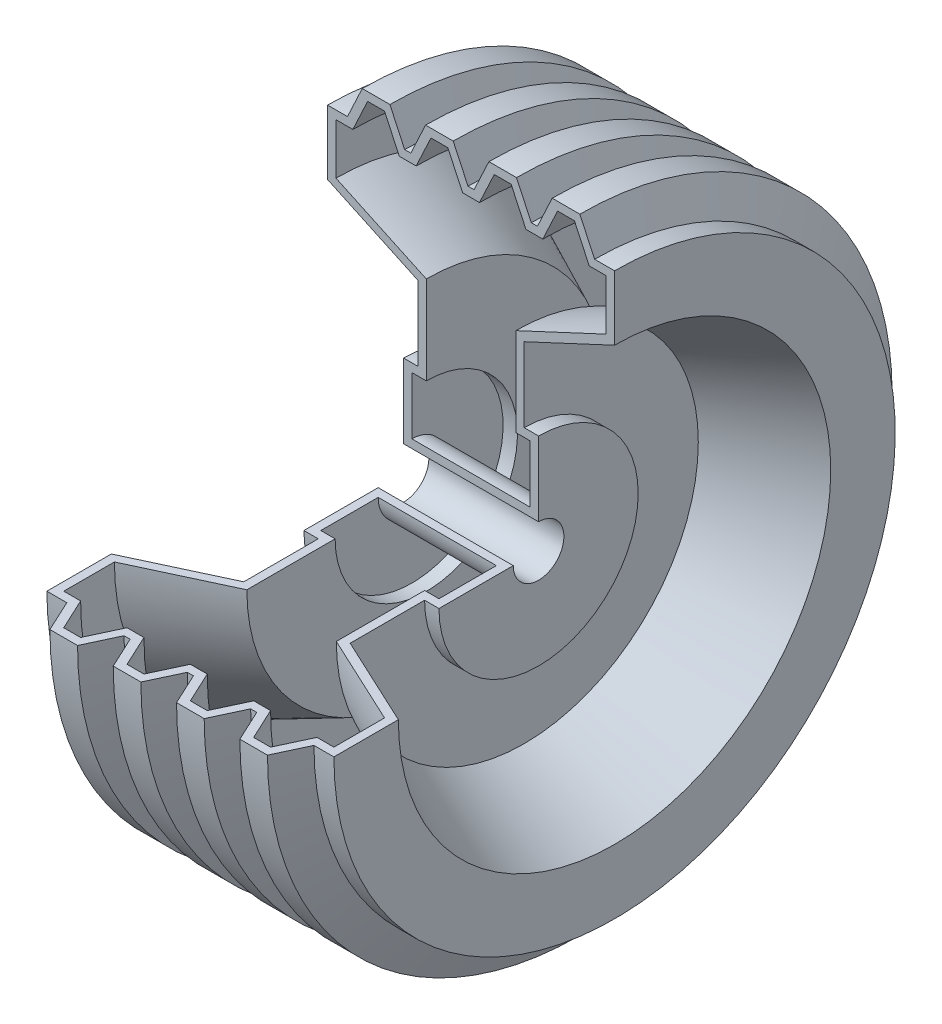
ISO-10303-21;
HEADER;
FILE_DESCRIPTION(('STEP AP214'),'2;1');
FILE_NAME('part.step','',(''),(''),'','','');
FILE_SCHEMA(('AUTOMOTIVE_DESIGN { 1 0 10303 214 1 1 1 1 }'));
ENDSEC;
DATA;
#1=APPLICATION_CONTEXT('core data for automotive mechanical design processes');
#2=APPLICATION_PROTOCOL_DEFINITION('international standard','automotive_design',2000,#1);
#3=PRODUCT_CONTEXT('',#1,'mechanical');
#4=PRODUCT('Part','Part','',(#3));
#5=PRODUCT_RELATED_PRODUCT_CATEGORY('part','',(#4));
#6=PRODUCT_DEFINITION_FORMATION('','',#4);
#7=PRODUCT_DEFINITION_CONTEXT('part definition',#1,'design');
#8=PRODUCT_DEFINITION('design','',#6,#7);
#9=PRODUCT_DEFINITION_SHAPE('','',#8);
#10=(LENGTH_UNIT() NAMED_UNIT(*) SI_UNIT(.MILLI.,.METRE.));
#11=(NAMED_UNIT(*) PLANE_ANGLE_UNIT() SI_UNIT($,.RADIAN.));
#12=(NAMED_UNIT(*) SI_UNIT($,.STERADIAN.) SOLID_ANGLE_UNIT());
#13=UNCERTAINTY_MEASURE_WITH_UNIT(LENGTH_MEASURE(1.E-05),#10,'distance_accuracy_value','');
#14=(GEOMETRIC_REPRESENTATION_CONTEXT(3) GLOBAL_UNCERTAINTY_ASSIGNED_CONTEXT((#13)) GLOBAL_UNIT_ASSIGNED_CONTEXT((#10,
#11,#12)) REPRESENTATION_CONTEXT('',''));
#15=CARTESIAN_POINT('',(0.,0.,0.));
#16=DIRECTION('',(0.,0.,1.));
#17=DIRECTION('',(1.,0.,0.));
#18=AXIS2_PLACEMENT_3D('',#15,#16,#17);
#19=CARTESIAN_POINT('',(-70.7632107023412,0.,0.));
#20=DIRECTION('',(1.,0.,0.));
#21=DIRECTION('',(0.,0.,-1.));
#22=AXIS2_PLACEMENT_3D('',#19,#20,#21);
#23=CYLINDRICAL_SURFACE('',#22,59.);
#24=CARTESIAN_POINT('',(40.,0.,0.));
#25=DIRECTION('',(1.,0.,0.));
#26=DIRECTION('',(0.,0.,-1.));
#27=AXIS2_PLACEMENT_3D('',#24,#25,#26);
#28=CIRCLE('',#27,59.);
#29=CARTESIAN_POINT('',(40.,6.17992196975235E-13,59.));
#30=VERTEX_POINT('',#29);
#31=CARTESIAN_POINT('',(40.,59.,0.));
#32=VERTEX_POINT('',#31);
#33=EDGE_CURVE('E11',#30,#32,#28,.T.);
#34=ORIENTED_EDGE('',*,*,#33,.F.);
#35=DIRECTION('',(-1.,0.,0.));
#36=VECTOR('',#35,1.);
#37=CARTESIAN_POINT('',(26.5,6.17992196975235E-13,59.));
#38=LINE('',#37,#36);
#39=CARTESIAN_POINT('',(31.5,6.17992196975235E-13,59.));
#40=VERTEX_POINT('',#39);
#41=EDGE_CURVE('E699',#30,#40,#38,.T.);
#42=ORIENTED_EDGE('',*,*,#41,.T.);
#43=CARTESIAN_POINT('',(31.5,0.,0.));
#44=DIRECTION('',(1.,0.,0.));
#45=DIRECTION('',(0.,0.,-1.));
#46=AXIS2_PLACEMENT_3D('',#43,#44,#45);
#47=CIRCLE('',#46,59.);
#48=CARTESIAN_POINT('',(31.5,59.,0.));
#49=VERTEX_POINT('',#48);
#50=EDGE_CURVE('E783',#40,#49,#47,.T.);
#51=ORIENTED_EDGE('',*,*,#50,.T.);
#52=DIRECTION('',(-1.,0.,0.));
#53=VECTOR('',#52,1.);
#54=CARTESIAN_POINT('',(26.5,59.,0.));
#55=LINE('',#54,#53);
#56=EDGE_CURVE('E615',#32,#49,#55,.T.);
#57=ORIENTED_EDGE('',*,*,#56,.F.);
#58=EDGE_LOOP('',(#34,#42,#51,#57));
#59=FACE_BOUND('',#58,.T.);
#60=ADVANCED_FACE('F34',(#59),#23,.T.);
#61=CARTESIAN_POINT('',(40.,5.65619976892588E-13,54.));
#62=DIRECTION('',(1.,0.,0.));
#63=DIRECTION('',(0.,0.,-1.));
#64=AXIS2_PLACEMENT_3D('',#61,#62,#63);
#65=PLANE('',#64);
#66=CARTESIAN_POINT('',(40.,0.,0.));
#67=DIRECTION('',(1.,0.,0.));
#68=DIRECTION('',(0.,0.,-1.));
#69=AXIS2_PLACEMENT_3D('',#66,#67,#68);
#70=CIRCLE('',#69,15.);
#71=CARTESIAN_POINT('',(40.,1.57116660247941E-13,15.));
#72=VERTEX_POINT('',#71);
#73=CARTESIAN_POINT('',(40.,15.,0.));
#74=VERTEX_POINT('',#73);
#75=EDGE_CURVE('E42',#72,#74,#70,.T.);
#76=ORIENTED_EDGE('',*,*,#75,.F.);
#77=DIRECTION('',(0.,0.,1.));
#78=VECTOR('',#77,1.);
#79=CARTESIAN_POINT('',(40.,5.65619976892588E-13,54.));
#80=LINE('',#79,#78);
#81=EDGE_CURVE('E780',#72,#30,#80,.T.);
#82=ORIENTED_EDGE('',*,*,#81,.T.);
#83=ORIENTED_EDGE('',*,*,#33,.T.);
#84=DIRECTION('',(0.,1.,0.));
#85=VECTOR('',#84,1.);
#86=CARTESIAN_POINT('',(40.,54.,0.));
#87=LINE('',#86,#85);
#88=EDGE_CURVE('E696',#74,#32,#87,.T.);
#89=ORIENTED_EDGE('',*,*,#88,.F.);
#90=EDGE_LOOP('',(#76,#82,#83,#89));
#91=FACE_BOUND('',#90,.T.);
#92=ADVANCED_FACE('F36',(#91),#65,.T.);
#93=CARTESIAN_POINT('',(-70.7632107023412,0.,0.));
#94=DIRECTION('',(1.,0.,0.));
#95=DIRECTION('',(0.,0.,-1.));
#96=AXIS2_PLACEMENT_3D('',#93,#94,#95);
#97=CYLINDRICAL_SURFACE('',#96,15.);
#98=CARTESIAN_POINT('',(-40.,0.,0.));
#99=DIRECTION('',(1.,0.,0.));
#100=DIRECTION('',(0.,0.,-1.));
#101=AXIS2_PLACEMENT_3D('',#98,#99,#100);
#102=CIRCLE('',#101,15.);
#103=CARTESIAN_POINT('',(-40.,1.57116660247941E-13,15.));
#104=VERTEX_POINT('',#103);
#105=CARTESIAN_POINT('',(-40.,15.,0.));
#106=VERTEX_POINT('',#105);
#107=EDGE_CURVE('E833',#104,#106,#102,.T.);
#108=ORIENTED_EDGE('',*,*,#107,.F.);
#109=DIRECTION('',(1.,0.,0.));
#110=VECTOR('',#109,1.);
#111=CARTESIAN_POINT('',(26.5,1.57116660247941E-13,15.));
#112=LINE('',#111,#110);
#113=EDGE_CURVE('E777',#104,#72,#112,.T.);
#114=ORIENTED_EDGE('',*,*,#113,.T.);
#115=ORIENTED_EDGE('',*,*,#75,.T.);
#116=DIRECTION('',(1.,0.,0.));
#117=VECTOR('',#116,1.);
#118=CARTESIAN_POINT('',(26.5,15.,0.));
#119=LINE('',#118,#117);
#120=EDGE_CURVE('E693',#106,#74,#119,.T.);
#121=ORIENTED_EDGE('',*,*,#120,.F.);
#122=EDGE_LOOP('',(#108,#114,#115,#121));
#123=FACE_BOUND('',#122,.T.);
#124=ADVANCED_FACE('F836',(#123),#97,.F.);
#125=CARTESIAN_POINT('',(-40.,5.65619976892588E-13,54.));
#126=DIRECTION('',(-1.,0.,0.));
#127=DIRECTION('',(0.,0.,1.));
#128=AXIS2_PLACEMENT_3D('',#125,#126,#127);
#129=PLANE('',#128);
#130=CARTESIAN_POINT('',(-40.,0.,0.));
#131=DIRECTION('',(1.,0.,0.));
#132=DIRECTION('',(0.,0.,-1.));
#133=AXIS2_PLACEMENT_3D('',#130,#131,#132);
#134=CIRCLE('',#133,59.);
#135=CARTESIAN_POINT('',(-40.,6.17992196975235E-13,59.));
#136=VERTEX_POINT('',#135);
#137=CARTESIAN_POINT('',(-40.,59.,0.));
#138=VERTEX_POINT('',#137);
#139=EDGE_CURVE('E831',#136,#138,#134,.T.);
#140=ORIENTED_EDGE('',*,*,#139,.F.);
#141=DIRECTION('',(0.,0.,-1.));
#142=VECTOR('',#141,1.);
#143=CARTESIAN_POINT('',(-40.,5.65619976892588E-13,54.));
#144=LINE('',#143,#142);
#145=EDGE_CURVE('E774',#136,#104,#144,.T.);
#146=ORIENTED_EDGE('',*,*,#145,.T.);
#147=ORIENTED_EDGE('',*,*,#107,.T.);
#148=DIRECTION('',(0.,-1.,0.));
#149=VECTOR('',#148,1.);
#150=CARTESIAN_POINT('',(-40.,54.,0.));
#151=LINE('',#150,#149);
#152=EDGE_CURVE('E690',#138,#106,#151,.T.);
#153=ORIENTED_EDGE('',*,*,#152,.F.);
#154=EDGE_LOOP('',(#140,#146,#147,#153));
#155=FACE_BOUND('',#154,.T.);
#156=ADVANCED_FACE('F941',(#155),#129,.T.);
#157=CARTESIAN_POINT('',(-70.7632107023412,0.,0.));
#158=DIRECTION('',(1.,0.,0.));
#159=DIRECTION('',(0.,0.,-1.));
#160=AXIS2_PLACEMENT_3D('',#157,#158,#159);
#161=CYLINDRICAL_SURFACE('',#160,59.);
#162=CARTESIAN_POINT('',(-31.5,0.,0.));
#163=DIRECTION('',(1.,0.,0.));
#164=DIRECTION('',(0.,0.,-1.));
#165=AXIS2_PLACEMENT_3D('',#162,#163,#164);
#166=CIRCLE('',#165,59.);
#167=CARTESIAN_POINT('',(-31.5,6.17992196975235E-13,59.));
#168=VERTEX_POINT('',#167);
#169=CARTESIAN_POINT('',(-31.5,59.,0.));
#170=VERTEX_POINT('',#169);
#171=EDGE_CURVE('E829',#168,#170,#166,.T.);
#172=ORIENTED_EDGE('',*,*,#171,.F.);
#173=DIRECTION('',(-1.,0.,0.));
#174=VECTOR('',#173,1.);
#175=CARTESIAN_POINT('',(26.5,6.17992196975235E-13,59.));
#176=LINE('',#175,#174);
#177=EDGE_CURVE('E771',#168,#136,#176,.T.);
#178=ORIENTED_EDGE('',*,*,#177,.T.);
#179=ORIENTED_EDGE('',*,*,#139,.T.);
#180=DIRECTION('',(-1.,0.,0.));
#181=VECTOR('',#180,1.);
#182=CARTESIAN_POINT('',(26.5,59.,0.));
#183=LINE('',#182,#181);
#184=EDGE_CURVE('E687',#170,#138,#183,.T.);
#185=ORIENTED_EDGE('',*,*,#184,.F.);
#186=EDGE_LOOP('',(#172,#178,#179,#185));
#187=FACE_BOUND('',#186,.T.);
#188=ADVANCED_FACE('F938',(#187),#161,.T.);
#189=CARTESIAN_POINT('',(-31.5,5.65619976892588E-13,54.));
#190=DIRECTION('',(-1.,0.,0.));
#191=DIRECTION('',(0.,0.,1.));
#192=AXIS2_PLACEMENT_3D('',#189,#190,#191);
#193=PLANE('',#192);
#194=CARTESIAN_POINT('',(-31.5,0.,0.));
#195=DIRECTION('',(1.,0.,0.));
#196=DIRECTION('',(0.,0.,-1.));
#197=AXIS2_PLACEMENT_3D('',#194,#195,#196);
#198=CIRCLE('',#197,103.102753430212);
#199=CARTESIAN_POINT('',(-31.5,1.07994401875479E-12,103.102753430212));
#200=VERTEX_POINT('',#199);
#201=CARTESIAN_POINT('',(-31.5,103.102753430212,0.));
#202=VERTEX_POINT('',#201);
#203=EDGE_CURVE('E827',#200,#202,#198,.T.);
#204=ORIENTED_EDGE('',*,*,#203,.F.);
#205=DIRECTION('',(0.,0.,-1.));
#206=VECTOR('',#205,1.);
#207=CARTESIAN_POINT('',(-31.5,5.65619976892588E-13,54.));
#208=LINE('',#207,#206);
#209=EDGE_CURVE('E768',#200,#168,#208,.T.);
#210=ORIENTED_EDGE('',*,*,#209,.T.);
#211=ORIENTED_EDGE('',*,*,#171,.T.);
#212=DIRECTION('',(0.,-1.,0.));
#213=VECTOR('',#212,1.);
#214=CARTESIAN_POINT('',(-31.5,54.,0.));
#215=LINE('',#214,#213);
#216=EDGE_CURVE('E684',#202,#170,#215,.T.);
#217=ORIENTED_EDGE('',*,*,#216,.F.);
#218=EDGE_LOOP('',(#204,#210,#211,#217));
#219=FACE_BOUND('',#218,.T.);
#220=ADVANCED_FACE('F934',(#219),#193,.T.);
#221=CARTESIAN_POINT('',(-85.,0.,0.));
#222=DIRECTION('',(-1.,0.,0.));
#223=DIRECTION('',(0.,0.,1.));
#224=AXIS2_PLACEMENT_3D('',#221,#222,#223);
#225=CONICAL_SURFACE('',#224,128.050213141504,0.43633231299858);
#226=CARTESIAN_POINT('',(-85.,0.,0.));
#227=DIRECTION('',(1.,0.,0.));
#228=DIRECTION('',(0.,0.,-1.));
#229=AXIS2_PLACEMENT_3D('',#226,#227,#228);
#230=CIRCLE('',#229,128.050213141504);
#231=CARTESIAN_POINT('',(-85.,1.34125478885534E-12,128.050213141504));
#232=VERTEX_POINT('',#231);
#233=CARTESIAN_POINT('',(-85.,128.050213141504,0.));
#234=VERTEX_POINT('',#233);
#235=EDGE_CURVE('E825',#232,#234,#230,.T.);
#236=ORIENTED_EDGE('',*,*,#235,.F.);
#237=DIRECTION('',(0.906307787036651,0.,-0.422618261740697));
#238=VECTOR('',#237,1.);
#239=CARTESIAN_POINT('',(34.9482863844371,7.55389759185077E-13,72.1174086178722));
#240=LINE('',#239,#238);
#241=EDGE_CURVE('E765',#232,#200,#240,.T.);
#242=ORIENTED_EDGE('',*,*,#241,.T.);
#243=ORIENTED_EDGE('',*,*,#203,.T.);
#244=DIRECTION('',(0.906307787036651,-0.422618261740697,0.));
#245=VECTOR('',#244,1.);
#246=CARTESIAN_POINT('',(34.9482863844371,72.1174086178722,0.));
#247=LINE('',#246,#245);
#248=EDGE_CURVE('E681',#234,#202,#247,.T.);
#249=ORIENTED_EDGE('',*,*,#248,.F.);
#250=EDGE_LOOP('',(#236,#242,#243,#249));
#251=FACE_BOUND('',#250,.T.);
#252=ADVANCED_FACE('F931',(#251),#225,.F.);
#253=CARTESIAN_POINT('',(-85.,5.65619976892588E-13,54.));
#254=DIRECTION('',(-1.,0.,0.));
#255=DIRECTION('',(0.,0.,1.));
#256=AXIS2_PLACEMENT_3D('',#253,#254,#255);
#257=PLANE('',#256);
#258=CARTESIAN_POINT('',(-85.,0.,0.));
#259=DIRECTION('',(1.,0.,0.));
#260=DIRECTION('',(0.,0.,-1.));
#261=AXIS2_PLACEMENT_3D('',#258,#259,#260);
#262=CIRCLE('',#261,166.235564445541);
#263=CARTESIAN_POINT('',(-85.,1.74122511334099E-12,166.235564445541));
#264=VERTEX_POINT('',#263);
#265=CARTESIAN_POINT('',(-85.,166.235564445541,0.));
#266=VERTEX_POINT('',#265);
#267=EDGE_CURVE('E823',#264,#266,#262,.T.);
#268=ORIENTED_EDGE('',*,*,#267,.F.);
#269=DIRECTION('',(0.,0.,-1.));
#270=VECTOR('',#269,1.);
#271=CARTESIAN_POINT('',(-85.,5.65619976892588E-13,54.));
#272=LINE('',#271,#270);
#273=EDGE_CURVE('E762',#264,#232,#272,.T.);
#274=ORIENTED_EDGE('',*,*,#273,.T.);
#275=ORIENTED_EDGE('',*,*,#235,.T.);
#276=DIRECTION('',(0.,-1.,0.));
#277=VECTOR('',#276,1.);
#278=CARTESIAN_POINT('',(-85.,54.,0.));
#279=LINE('',#278,#277);
#280=EDGE_CURVE('E678',#266,#234,#279,.T.);
#281=ORIENTED_EDGE('',*,*,#280,.F.);
#282=EDGE_LOOP('',(#268,#274,#275,#281));
#283=FACE_BOUND('',#282,.T.);
#284=ADVANCED_FACE('F926',(#283),#257,.T.);
#285=CARTESIAN_POINT('',(-70.7632107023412,0.,0.));
#286=DIRECTION('',(1.,0.,0.));
#287=DIRECTION('',(0.,0.,-1.));
#288=AXIS2_PLACEMENT_3D('',#285,#286,#287);
#289=CYLINDRICAL_SURFACE('',#288,166.235564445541);
#290=CARTESIAN_POINT('',(-73.1853513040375,0.,0.));
#291=DIRECTION('',(1.,0.,0.));
#292=DIRECTION('',(0.,0.,-1.));
#293=AXIS2_PLACEMENT_3D('',#290,#291,#292);
#294=CIRCLE('',#293,166.235564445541);
#295=CARTESIAN_POINT('',(-73.1853513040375,1.74122511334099E-12,166.235564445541));
#296=VERTEX_POINT('',#295);
#297=CARTESIAN_POINT('',(-73.1853513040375,166.235564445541,0.));
#298=VERTEX_POINT('',#297);
#299=EDGE_CURVE('E821',#296,#298,#294,.T.);
#300=ORIENTED_EDGE('',*,*,#299,.F.);
#301=DIRECTION('',(-1.,0.,0.));
#302=VECTOR('',#301,1.);
#303=CARTESIAN_POINT('',(26.5000000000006,1.74122511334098E-12,166.235564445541));
#304=LINE('',#303,#302);
#305=EDGE_CURVE('E759',#296,#264,#304,.T.);
#306=ORIENTED_EDGE('',*,*,#305,.T.);
#307=ORIENTED_EDGE('',*,*,#267,.T.);
#308=DIRECTION('',(-1.,0.,0.));
#309=VECTOR('',#308,1.);
#310=CARTESIAN_POINT('',(26.5000000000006,166.235564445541,0.));
#311=LINE('',#310,#309);
#312=EDGE_CURVE('E675',#298,#266,#311,.T.);
#313=ORIENTED_EDGE('',*,*,#312,.F.);
#314=EDGE_LOOP('',(#300,#306,#307,#313));
#315=FACE_BOUND('',#314,.T.);
#316=ADVANCED_FACE('F923',(#315),#289,.T.);
#317=CARTESIAN_POINT('',(-64.4353513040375,0.,0.));
#318=DIRECTION('',(1.,0.,0.));
#319=DIRECTION('',(0.,0.,-1.));
#320=AXIS2_PLACEMENT_3D('',#317,#318,#319);
#321=CONICAL_SURFACE('',#320,185.,1.13446401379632);
#322=CARTESIAN_POINT('',(-64.4353513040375,0.,0.));
#323=DIRECTION('',(1.,0.,0.));
#324=DIRECTION('',(0.,0.,-1.));
#325=AXIS2_PLACEMENT_3D('',#322,#323,#324);
#326=CIRCLE('',#325,185.);
#327=CARTESIAN_POINT('',(-64.4353513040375,1.93777214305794E-12,185.));
#328=VERTEX_POINT('',#327);
#329=CARTESIAN_POINT('',(-64.4353513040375,185.,0.));
#330=VERTEX_POINT('',#329);
#331=EDGE_CURVE('E819',#328,#330,#326,.T.);
#332=ORIENTED_EDGE('',*,*,#331,.F.);
#333=DIRECTION('',(-0.422618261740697,0.,-0.906307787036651));
#334=VECTOR('',#333,1.);
#335=CARTESIAN_POINT('',(-98.3696452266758,1.17552246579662E-12,112.227671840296));
#336=LINE('',#335,#334);
#337=EDGE_CURVE('E756',#328,#296,#336,.T.);
#338=ORIENTED_EDGE('',*,*,#337,.T.);
#339=ORIENTED_EDGE('',*,*,#299,.T.);
#340=DIRECTION('',(-0.422618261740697,-0.906307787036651,0.));
#341=VECTOR('',#340,1.);
#342=CARTESIAN_POINT('',(-98.3696452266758,112.227671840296,0.));
#343=LINE('',#342,#341);
#344=EDGE_CURVE('E672',#330,#298,#343,.T.);
#345=ORIENTED_EDGE('',*,*,#344,.F.);
#346=EDGE_LOOP('',(#332,#338,#339,#345));
#347=FACE_BOUND('',#346,.T.);
#348=ADVANCED_FACE('F918',(#347),#321,.T.);
#349=CARTESIAN_POINT('',(-70.7632107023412,0.,0.));
#350=DIRECTION('',(1.,0.,0.));
#351=DIRECTION('',(0.,0.,-1.));
#352=AXIS2_PLACEMENT_3D('',#349,#350,#351);
#353=CYLINDRICAL_SURFACE('',#352,185.);
#354=CARTESIAN_POINT('',(-48.0646486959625,0.,0.));
#355=DIRECTION('',(1.,0.,0.));
#356=DIRECTION('',(0.,0.,-1.));
#357=AXIS2_PLACEMENT_3D('',#354,#355,#356);
#358=CIRCLE('',#357,185.);
#359=CARTESIAN_POINT('',(-48.0646486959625,1.93777214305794E-12,185.));
#360=VERTEX_POINT('',#359);
#361=CARTESIAN_POINT('',(-48.0646486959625,185.,0.));
#362=VERTEX_POINT('',#361);
#363=EDGE_CURVE('E817',#360,#362,#358,.T.);
#364=ORIENTED_EDGE('',*,*,#363,.F.);
#365=DIRECTION('',(-1.,0.,0.));
#366=VECTOR('',#365,1.);
#367=CARTESIAN_POINT('',(26.5,1.93777214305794E-12,185.));
#368=LINE('',#367,#366);
#369=EDGE_CURVE('E753',#360,#328,#368,.T.);
#370=ORIENTED_EDGE('',*,*,#369,.T.);
#371=ORIENTED_EDGE('',*,*,#331,.T.);
#372=DIRECTION('',(-1.,0.,0.));
#373=VECTOR('',#372,1.);
#374=CARTESIAN_POINT('',(26.5,185.,0.));
#375=LINE('',#374,#373);
#376=EDGE_CURVE('E669',#362,#330,#375,.T.);
#377=ORIENTED_EDGE('',*,*,#376,.F.);
#378=EDGE_LOOP('',(#364,#370,#371,#377));
#379=FACE_BOUND('',#378,.T.);
#380=ADVANCED_FACE('F915',(#379),#353,.T.);
#381=CARTESIAN_POINT('',(-39.3146486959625,0.,0.));
#382=DIRECTION('',(-1.,0.,0.));
#383=DIRECTION('',(0.,0.,1.));
#384=AXIS2_PLACEMENT_3D('',#381,#382,#383);
#385=CONICAL_SURFACE('',#384,166.235564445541,1.13446401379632);
#386=CARTESIAN_POINT('',(-39.3146486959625,0.,0.));
#387=DIRECTION('',(1.,0.,0.));
#388=DIRECTION('',(0.,0.,-1.));
#389=AXIS2_PLACEMENT_3D('',#386,#387,#388);
#390=CIRCLE('',#389,166.235564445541);
#391=CARTESIAN_POINT('',(-39.3146486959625,1.74122511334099E-12,166.235564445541));
#392=VERTEX_POINT('',#391);
#393=CARTESIAN_POINT('',(-39.3146486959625,166.235564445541,0.));
#394=VERTEX_POINT('',#393);
#395=EDGE_CURVE('E815',#392,#394,#390,.T.);
#396=ORIENTED_EDGE('',*,*,#395,.F.);
#397=DIRECTION('',(-0.422618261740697,0.,0.906307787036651));
#398=VECTOR('',#397,1.);
#399=CARTESIAN_POINT('',(15.4289705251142,5.11545598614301E-13,48.8374941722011));
#400=LINE('',#399,#398);
#401=EDGE_CURVE('E750',#392,#360,#400,.T.);
#402=ORIENTED_EDGE('',*,*,#401,.T.);
#403=ORIENTED_EDGE('',*,*,#363,.T.);
#404=DIRECTION('',(-0.422618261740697,0.906307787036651,0.));
#405=VECTOR('',#404,1.);
#406=CARTESIAN_POINT('',(15.4289705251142,48.8374941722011,0.));
#407=LINE('',#406,#405);
#408=EDGE_CURVE('E666',#394,#362,#407,.T.);
#409=ORIENTED_EDGE('',*,*,#408,.F.);
#410=EDGE_LOOP('',(#396,#402,#403,#409));
#411=FACE_BOUND('',#410,.T.);
#412=ADVANCED_FACE('F910',(#411),#385,.T.);
#413=CARTESIAN_POINT('',(-70.7632107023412,0.,0.));
#414=DIRECTION('',(1.,0.,0.));
#415=DIRECTION('',(0.,0.,-1.));
#416=AXIS2_PLACEMENT_3D('',#413,#414,#415);
#417=CYLINDRICAL_SURFACE('',#416,166.235564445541);
#418=CARTESIAN_POINT('',(-35.6853513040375,0.,0.));
#419=DIRECTION('',(1.,0.,0.));
#420=DIRECTION('',(0.,0.,-1.));
#421=AXIS2_PLACEMENT_3D('',#418,#419,#420);
#422=CIRCLE('',#421,166.235564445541);
#423=CARTESIAN_POINT('',(-35.6853513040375,1.74122511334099E-12,166.235564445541));
#424=VERTEX_POINT('',#423);
#425=CARTESIAN_POINT('',(-35.6853513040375,166.235564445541,0.));
#426=VERTEX_POINT('',#425);
#427=EDGE_CURVE('E813',#424,#426,#422,.T.);
#428=ORIENTED_EDGE('',*,*,#427,.F.);
#429=DIRECTION('',(-1.,0.,0.));
#430=VECTOR('',#429,1.);
#431=CARTESIAN_POINT('',(26.5,1.74122511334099E-12,166.235564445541));
#432=LINE('',#431,#430);
#433=EDGE_CURVE('E747',#424,#392,#432,.T.);
#434=ORIENTED_EDGE('',*,*,#433,.T.);
#435=ORIENTED_EDGE('',*,*,#395,.T.);
#436=DIRECTION('',(-1.,0.,0.));
#437=VECTOR('',#436,1.);
#438=CARTESIAN_POINT('',(26.5,166.235564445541,0.));
#439=LINE('',#438,#437);
#440=EDGE_CURVE('E663',#426,#394,#439,.T.);
#441=ORIENTED_EDGE('',*,*,#440,.F.);
#442=EDGE_LOOP('',(#428,#434,#435,#441));
#443=FACE_BOUND('',#442,.T.);
#444=ADVANCED_FACE('F907',(#443),#417,.T.);
#445=CARTESIAN_POINT('',(-26.9353513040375,0.,0.));
#446=DIRECTION('',(1.,0.,0.));
#447=DIRECTION('',(0.,0.,-1.));
#448=AXIS2_PLACEMENT_3D('',#445,#446,#447);
#449=CONICAL_SURFACE('',#448,185.,1.13446401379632);
#450=CARTESIAN_POINT('',(-26.9353513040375,0.,0.));
#451=DIRECTION('',(1.,0.,0.));
#452=DIRECTION('',(0.,0.,-1.));
#453=AXIS2_PLACEMENT_3D('',#450,#451,#452);
#454=CIRCLE('',#453,185.);
#455=CARTESIAN_POINT('',(-26.9353513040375,1.93777214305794E-12,185.));
#456=VERTEX_POINT('',#455);
#457=CARTESIAN_POINT('',(-26.9353513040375,185.,0.));
#458=VERTEX_POINT('',#457);
#459=EDGE_CURVE('E811',#456,#458,#454,.T.);
#460=ORIENTED_EDGE('',*,*,#459,.F.);
#461=DIRECTION('',(-0.422618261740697,0.,-0.906307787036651));
#462=VECTOR('',#461,1.);
#463=CARTESIAN_POINT('',(-67.5673775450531,1.02507453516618E-12,97.8643385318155));
#464=LINE('',#463,#462);
#465=EDGE_CURVE('E744',#456,#424,#464,.T.);
#466=ORIENTED_EDGE('',*,*,#465,.T.);
#467=ORIENTED_EDGE('',*,*,#427,.T.);
#468=DIRECTION('',(-0.422618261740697,-0.906307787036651,0.));
#469=VECTOR('',#468,1.);
#470=CARTESIAN_POINT('',(-67.5673775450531,97.8643385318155,0.));
#471=LINE('',#470,#469);
#472=EDGE_CURVE('E660',#458,#426,#471,.T.);
#473=ORIENTED_EDGE('',*,*,#472,.F.);
#474=EDGE_LOOP('',(#460,#466,#467,#473));
#475=FACE_BOUND('',#474,.T.);
#476=ADVANCED_FACE('F902',(#475),#449,.T.);
#477=CARTESIAN_POINT('',(-70.7632107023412,0.,0.));
#478=DIRECTION('',(1.,0.,0.));
#479=DIRECTION('',(0.,0.,-1.));
#480=AXIS2_PLACEMENT_3D('',#477,#478,#479);
#481=CYLINDRICAL_SURFACE('',#480,185.);
#482=CARTESIAN_POINT('',(-10.5646486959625,0.,0.));
#483=DIRECTION('',(1.,0.,0.));
#484=DIRECTION('',(0.,0.,-1.));
#485=AXIS2_PLACEMENT_3D('',#482,#483,#484);
#486=CIRCLE('',#485,185.);
#487=CARTESIAN_POINT('',(-10.5646486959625,1.93777214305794E-12,185.));
#488=VERTEX_POINT('',#487);
#489=CARTESIAN_POINT('',(-10.5646486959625,185.,0.));
#490=VERTEX_POINT('',#489);
#491=EDGE_CURVE('E809',#488,#490,#486,.T.);
#492=ORIENTED_EDGE('',*,*,#491,.F.);
#493=DIRECTION('',(-1.,0.,0.));
#494=VECTOR('',#493,1.);
#495=CARTESIAN_POINT('',(26.5,1.93777214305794E-12,185.));
#496=LINE('',#495,#494);
#497=EDGE_CURVE('E741',#488,#456,#496,.T.);
#498=ORIENTED_EDGE('',*,*,#497,.T.);
#499=ORIENTED_EDGE('',*,*,#459,.T.);
#500=DIRECTION('',(-1.,0.,0.));
#501=VECTOR('',#500,1.);
#502=CARTESIAN_POINT('',(26.5,185.,0.));
#503=LINE('',#502,#501);
#504=EDGE_CURVE('E657',#490,#458,#503,.T.);
#505=ORIENTED_EDGE('',*,*,#504,.F.);
#506=EDGE_LOOP('',(#492,#498,#499,#505));
#507=FACE_BOUND('',#506,.T.);
#508=ADVANCED_FACE('F899',(#507),#481,.T.);
#509=CARTESIAN_POINT('',(-1.81464869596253,0.,0.));
#510=DIRECTION('',(-1.,0.,0.));
#511=DIRECTION('',(0.,0.,1.));
#512=AXIS2_PLACEMENT_3D('',#509,#510,#511);
#513=CONICAL_SURFACE('',#512,166.235564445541,1.13446401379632);
#514=CARTESIAN_POINT('',(-1.81464869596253,0.,0.));
#515=DIRECTION('',(1.,0.,0.));
#516=DIRECTION('',(0.,0.,-1.));
#517=AXIS2_PLACEMENT_3D('',#514,#515,#516);
#518=CIRCLE('',#517,166.235564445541);
#519=CARTESIAN_POINT('',(-1.81464869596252,1.74122511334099E-12,166.235564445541));
#520=VERTEX_POINT('',#519);
#521=CARTESIAN_POINT('',(-1.81464869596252,166.235564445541,0.));
#522=VERTEX_POINT('',#521);
#523=EDGE_CURVE('E807',#520,#522,#518,.T.);
#524=ORIENTED_EDGE('',*,*,#523,.F.);
#525=DIRECTION('',(-0.422618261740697,0.,0.906307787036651));
#526=VECTOR('',#525,1.);
#527=CARTESIAN_POINT('',(46.231238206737,6.61993529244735E-13,63.2008274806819));
#528=LINE('',#527,#526);
#529=EDGE_CURVE('E738',#520,#488,#528,.T.);
#530=ORIENTED_EDGE('',*,*,#529,.T.);
#531=ORIENTED_EDGE('',*,*,#491,.T.);
#532=DIRECTION('',(-0.422618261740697,0.906307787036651,0.));
#533=VECTOR('',#532,1.);
#534=CARTESIAN_POINT('',(46.231238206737,63.2008274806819,0.));
#535=LINE('',#534,#533);
#536=EDGE_CURVE('E654',#522,#490,#535,.T.);
#537=ORIENTED_EDGE('',*,*,#536,.F.);
#538=EDGE_LOOP('',(#524,#530,#531,#537));
#539=FACE_BOUND('',#538,.T.);
#540=ADVANCED_FACE('F894',(#539),#513,.T.);
#541=CARTESIAN_POINT('',(-70.7632107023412,0.,0.));
#542=DIRECTION('',(1.,0.,0.));
#543=DIRECTION('',(0.,0.,-1.));
#544=AXIS2_PLACEMENT_3D('',#541,#542,#543);
#545=CYLINDRICAL_SURFACE('',#544,166.235564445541);
#546=CARTESIAN_POINT('',(1.81464869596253,0.,0.));
#547=DIRECTION('',(1.,0.,0.));
#548=DIRECTION('',(0.,0.,-1.));
#549=AXIS2_PLACEMENT_3D('',#546,#547,#548);
#550=CIRCLE('',#549,166.235564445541);
#551=CARTESIAN_POINT('',(1.81464869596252,1.74122511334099E-12,166.235564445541));
#552=VERTEX_POINT('',#551);
#553=CARTESIAN_POINT('',(1.81464869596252,166.235564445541,0.));
#554=VERTEX_POINT('',#553);
#555=EDGE_CURVE('E805',#552,#554,#550,.T.);
#556=ORIENTED_EDGE('',*,*,#555,.F.);
#557=DIRECTION('',(-1.,0.,0.));
#558=VECTOR('',#557,1.);
#559=CARTESIAN_POINT('',(26.5,1.74122511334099E-12,166.235564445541));
#560=LINE('',#559,#558);
#561=EDGE_CURVE('E735',#552,#520,#560,.T.);
#562=ORIENTED_EDGE('',*,*,#561,.T.);
#563=ORIENTED_EDGE('',*,*,#523,.T.);
#564=DIRECTION('',(-1.,0.,0.));
#565=VECTOR('',#564,1.);
#566=CARTESIAN_POINT('',(26.5,166.235564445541,0.));
#567=LINE('',#566,#565);
#568=EDGE_CURVE('E651',#554,#522,#567,.T.);
#569=ORIENTED_EDGE('',*,*,#568,.F.);
#570=EDGE_LOOP('',(#556,#562,#563,#569));
#571=FACE_BOUND('',#570,.T.);
#572=ADVANCED_FACE('F891',(#571),#545,.T.);
#573=CARTESIAN_POINT('',(10.5646486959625,0.,0.));
#574=DIRECTION('',(1.,0.,0.));
#575=DIRECTION('',(0.,0.,-1.));
#576=AXIS2_PLACEMENT_3D('',#573,#574,#575);
#577=CONICAL_SURFACE('',#576,185.,1.13446401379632);
#578=CARTESIAN_POINT('',(10.5646486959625,0.,0.));
#579=DIRECTION('',(1.,0.,0.));
#580=DIRECTION('',(0.,0.,-1.));
#581=AXIS2_PLACEMENT_3D('',#578,#579,#580);
#582=CIRCLE('',#581,185.);
#583=CARTESIAN_POINT('',(10.5646486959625,1.93777214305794E-12,185.));
#584=VERTEX_POINT('',#583);
#585=CARTESIAN_POINT('',(10.5646486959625,185.,0.));
#586=VERTEX_POINT('',#585);
#587=EDGE_CURVE('E803',#584,#586,#582,.T.);
#588=ORIENTED_EDGE('',*,*,#587,.F.);
#589=DIRECTION('',(-0.422618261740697,0.,-0.906307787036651));
#590=VECTOR('',#589,1.);
#591=CARTESIAN_POINT('',(-36.7651098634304,8.74626604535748E-13,83.5010052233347));
#592=LINE('',#591,#590);
#593=EDGE_CURVE('E732',#584,#552,#592,.T.);
#594=ORIENTED_EDGE('',*,*,#593,.T.);
#595=ORIENTED_EDGE('',*,*,#555,.T.);
#596=DIRECTION('',(-0.422618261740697,-0.906307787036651,0.));
#597=VECTOR('',#596,1.);
#598=CARTESIAN_POINT('',(-36.7651098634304,83.5010052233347,0.));
#599=LINE('',#598,#597);
#600=EDGE_CURVE('E648',#586,#554,#599,.T.);
#601=ORIENTED_EDGE('',*,*,#600,.F.);
#602=EDGE_LOOP('',(#588,#594,#595,#601));
#603=FACE_BOUND('',#602,.T.);
#604=ADVANCED_FACE('F886',(#603),#577,.T.);
#605=CARTESIAN_POINT('',(-70.7632107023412,0.,0.));
#606=DIRECTION('',(1.,0.,0.));
#607=DIRECTION('',(0.,0.,-1.));
#608=AXIS2_PLACEMENT_3D('',#605,#606,#607);
#609=CYLINDRICAL_SURFACE('',#608,185.);
#610=CARTESIAN_POINT('',(26.9353513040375,0.,0.));
#611=DIRECTION('',(1.,0.,0.));
#612=DIRECTION('',(0.,0.,-1.));
#613=AXIS2_PLACEMENT_3D('',#610,#611,#612);
#614=CIRCLE('',#613,185.);
#615=CARTESIAN_POINT('',(26.9353513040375,1.93777214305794E-12,185.));
#616=VERTEX_POINT('',#615);
#617=CARTESIAN_POINT('',(26.9353513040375,185.,0.));
#618=VERTEX_POINT('',#617);
#619=EDGE_CURVE('E801',#616,#618,#614,.T.);
#620=ORIENTED_EDGE('',*,*,#619,.F.);
#621=DIRECTION('',(-1.,0.,0.));
#622=VECTOR('',#621,1.);
#623=CARTESIAN_POINT('',(26.5,1.93777214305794E-12,185.));
#624=LINE('',#623,#622);
#625=EDGE_CURVE('E729',#616,#584,#624,.T.);
#626=ORIENTED_EDGE('',*,*,#625,.T.);
#627=ORIENTED_EDGE('',*,*,#587,.T.);
#628=DIRECTION('',(-1.,0.,0.));
#629=VECTOR('',#628,1.);
#630=CARTESIAN_POINT('',(26.5,185.,0.));
#631=LINE('',#630,#629);
#632=EDGE_CURVE('E645',#618,#586,#631,.T.);
#633=ORIENTED_EDGE('',*,*,#632,.F.);
#634=EDGE_LOOP('',(#620,#626,#627,#633));
#635=FACE_BOUND('',#634,.T.);
#636=ADVANCED_FACE('F883',(#635),#609,.T.);
#637=CARTESIAN_POINT('',(35.6853513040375,0.,0.));
#638=DIRECTION('',(-1.,0.,0.));
#639=DIRECTION('',(0.,0.,1.));
#640=AXIS2_PLACEMENT_3D('',#637,#638,#639);
#641=CONICAL_SURFACE('',#640,166.235564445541,1.13446401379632);
#642=CARTESIAN_POINT('',(35.6853513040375,0.,0.));
#643=DIRECTION('',(1.,0.,0.));
#644=DIRECTION('',(0.,0.,-1.));
#645=AXIS2_PLACEMENT_3D('',#642,#643,#644);
#646=CIRCLE('',#645,166.235564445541);
#647=CARTESIAN_POINT('',(35.6853513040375,1.74122511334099E-12,166.235564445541));
#648=VERTEX_POINT('',#647);
#649=CARTESIAN_POINT('',(35.6853513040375,166.235564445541,0.));
#650=VERTEX_POINT('',#649);
#651=EDGE_CURVE('E799',#648,#650,#646,.T.);
#652=ORIENTED_EDGE('',*,*,#651,.F.);
#653=DIRECTION('',(-0.422618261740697,0.,0.906307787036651));
#654=VECTOR('',#653,1.);
#655=CARTESIAN_POINT('',(77.0335058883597,8.12441459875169E-13,77.5641607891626));
#656=LINE('',#655,#654);
#657=EDGE_CURVE('E726',#648,#616,#656,.T.);
#658=ORIENTED_EDGE('',*,*,#657,.T.);
#659=ORIENTED_EDGE('',*,*,#619,.T.);
#660=DIRECTION('',(-0.422618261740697,0.906307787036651,0.));
#661=VECTOR('',#660,1.);
#662=CARTESIAN_POINT('',(77.0335058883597,77.5641607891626,0.));
#663=LINE('',#662,#661);
#664=EDGE_CURVE('E642',#650,#618,#663,.T.);
#665=ORIENTED_EDGE('',*,*,#664,.F.);
#666=EDGE_LOOP('',(#652,#658,#659,#665));
#667=FACE_BOUND('',#666,.T.);
#668=ADVANCED_FACE('F878',(#667),#641,.T.);
#669=CARTESIAN_POINT('',(-70.7632107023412,0.,0.));
#670=DIRECTION('',(1.,0.,0.));
#671=DIRECTION('',(0.,0.,-1.));
#672=AXIS2_PLACEMENT_3D('',#669,#670,#671);
#673=CYLINDRICAL_SURFACE('',#672,166.235564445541);
#674=CARTESIAN_POINT('',(39.3146486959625,0.,0.));
#675=DIRECTION('',(1.,0.,0.));
#676=DIRECTION('',(0.,0.,-1.));
#677=AXIS2_PLACEMENT_3D('',#674,#675,#676);
#678=CIRCLE('',#677,166.235564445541);
#679=CARTESIAN_POINT('',(39.3146486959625,1.74122511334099E-12,166.235564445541));
#680=VERTEX_POINT('',#679);
#681=CARTESIAN_POINT('',(39.3146486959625,166.235564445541,0.));
#682=VERTEX_POINT('',#681);
#683=EDGE_CURVE('E797',#680,#682,#678,.T.);
#684=ORIENTED_EDGE('',*,*,#683,.F.);
#685=DIRECTION('',(-1.,0.,0.));
#686=VECTOR('',#685,1.);
#687=CARTESIAN_POINT('',(26.5,1.74122511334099E-12,166.235564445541));
#688=LINE('',#687,#686);
#689=EDGE_CURVE('E723',#680,#648,#688,.T.);
#690=ORIENTED_EDGE('',*,*,#689,.T.);
#691=ORIENTED_EDGE('',*,*,#651,.T.);
#692=DIRECTION('',(-1.,0.,0.));
#693=VECTOR('',#692,1.);
#694=CARTESIAN_POINT('',(26.5,166.235564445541,0.));
#695=LINE('',#694,#693);
#696=EDGE_CURVE('E639',#682,#650,#695,.T.);
#697=ORIENTED_EDGE('',*,*,#696,.F.);
#698=EDGE_LOOP('',(#684,#690,#691,#697));
#699=FACE_BOUND('',#698,.T.);
#700=ADVANCED_FACE('F875',(#699),#673,.T.);
#701=CARTESIAN_POINT('',(48.0646486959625,0.,0.));
#702=DIRECTION('',(1.,0.,0.));
#703=DIRECTION('',(0.,0.,-1.));
#704=AXIS2_PLACEMENT_3D('',#701,#702,#703);
#705=CONICAL_SURFACE('',#704,185.,1.13446401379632);
#706=CARTESIAN_POINT('',(48.0646486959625,0.,0.));
#707=DIRECTION('',(1.,0.,0.));
#708=DIRECTION('',(0.,0.,-1.));
#709=AXIS2_PLACEMENT_3D('',#706,#707,#708);
#710=CIRCLE('',#709,185.);
#711=CARTESIAN_POINT('',(48.0646486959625,1.93777214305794E-12,185.));
#712=VERTEX_POINT('',#711);
#713=CARTESIAN_POINT('',(48.0646486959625,185.,0.));
#714=VERTEX_POINT('',#713);
#715=EDGE_CURVE('E795',#712,#714,#710,.T.);
#716=ORIENTED_EDGE('',*,*,#715,.F.);
#717=DIRECTION('',(-0.422618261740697,0.,-0.906307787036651));
#718=VECTOR('',#717,1.);
#719=CARTESIAN_POINT('',(-5.96284218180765,7.24178673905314E-13,69.1376719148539));
#720=LINE('',#719,#718);
#721=EDGE_CURVE('E720',#712,#680,#720,.T.);
#722=ORIENTED_EDGE('',*,*,#721,.T.);
#723=ORIENTED_EDGE('',*,*,#683,.T.);
#724=DIRECTION('',(-0.422618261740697,-0.906307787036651,0.));
#725=VECTOR('',#724,1.);
#726=CARTESIAN_POINT('',(-5.96284218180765,69.1376719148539,0.));
#727=LINE('',#726,#725);
#728=EDGE_CURVE('E636',#714,#682,#727,.T.);
#729=ORIENTED_EDGE('',*,*,#728,.F.);
#730=EDGE_LOOP('',(#716,#722,#723,#729));
#731=FACE_BOUND('',#730,.T.);
#732=ADVANCED_FACE('F870',(#731),#705,.T.);
#733=CARTESIAN_POINT('',(-70.7632107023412,0.,0.));
#734=DIRECTION('',(1.,0.,0.));
#735=DIRECTION('',(0.,0.,-1.));
#736=AXIS2_PLACEMENT_3D('',#733,#734,#735);
#737=CYLINDRICAL_SURFACE('',#736,185.);
#738=CARTESIAN_POINT('',(64.4353513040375,0.,0.));
#739=DIRECTION('',(1.,0.,0.));
#740=DIRECTION('',(0.,0.,-1.));
#741=AXIS2_PLACEMENT_3D('',#738,#739,#740);
#742=CIRCLE('',#741,185.);
#743=CARTESIAN_POINT('',(64.4353513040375,1.93777214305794E-12,185.));
#744=VERTEX_POINT('',#743);
#745=CARTESIAN_POINT('',(64.4353513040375,185.,0.));
#746=VERTEX_POINT('',#745);
#747=EDGE_CURVE('E793',#744,#746,#742,.T.);
#748=ORIENTED_EDGE('',*,*,#747,.F.);
#749=DIRECTION('',(-1.,0.,0.));
#750=VECTOR('',#749,1.);
#751=CARTESIAN_POINT('',(26.5,1.93777214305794E-12,185.));
#752=LINE('',#751,#750);
#753=EDGE_CURVE('E717',#744,#712,#752,.T.);
#754=ORIENTED_EDGE('',*,*,#753,.T.);
#755=ORIENTED_EDGE('',*,*,#715,.T.);
#756=DIRECTION('',(-1.,0.,0.));
#757=VECTOR('',#756,1.);
#758=CARTESIAN_POINT('',(26.5,185.,0.));
#759=LINE('',#758,#757);
#760=EDGE_CURVE('E633',#746,#714,#759,.T.);
#761=ORIENTED_EDGE('',*,*,#760,.F.);
#762=EDGE_LOOP('',(#748,#754,#755,#761));
#763=FACE_BOUND('',#762,.T.);
#764=ADVANCED_FACE('F867',(#763),#737,.T.);
#765=CARTESIAN_POINT('',(73.1853513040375,0.,0.));
#766=DIRECTION('',(-1.,0.,0.));
#767=DIRECTION('',(0.,0.,1.));
#768=AXIS2_PLACEMENT_3D('',#765,#766,#767);
#769=CONICAL_SURFACE('',#768,166.235564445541,1.13446401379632);
#770=CARTESIAN_POINT('',(73.1853513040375,0.,0.));
#771=DIRECTION('',(1.,0.,0.));
#772=DIRECTION('',(0.,0.,-1.));
#773=AXIS2_PLACEMENT_3D('',#770,#771,#772);
#774=CIRCLE('',#773,166.235564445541);
#775=CARTESIAN_POINT('',(73.1853513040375,1.74122511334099E-12,166.235564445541));
#776=VERTEX_POINT('',#775);
#777=CARTESIAN_POINT('',(73.1853513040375,166.235564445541,0.));
#778=VERTEX_POINT('',#777);
#779=EDGE_CURVE('E791',#776,#778,#774,.T.);
#780=ORIENTED_EDGE('',*,*,#779,.F.);
#781=DIRECTION('',(-0.422618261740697,0.,0.906307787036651));
#782=VECTOR('',#781,1.);
#783=CARTESIAN_POINT('',(107.835773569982,9.62889390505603E-13,91.9274940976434));
#784=LINE('',#783,#782);
#785=EDGE_CURVE('E714',#776,#744,#784,.T.);
#786=ORIENTED_EDGE('',*,*,#785,.T.);
#787=ORIENTED_EDGE('',*,*,#747,.T.);
#788=DIRECTION('',(-0.422618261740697,0.906307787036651,0.));
#789=VECTOR('',#788,1.);
#790=CARTESIAN_POINT('',(107.835773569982,91.9274940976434,0.));
#791=LINE('',#790,#789);
#792=EDGE_CURVE('E630',#778,#746,#791,.T.);
#793=ORIENTED_EDGE('',*,*,#792,.F.);
#794=EDGE_LOOP('',(#780,#786,#787,#793));
#795=FACE_BOUND('',#794,.T.);
#796=ADVANCED_FACE('F862',(#795),#769,.T.);
#797=CARTESIAN_POINT('',(-70.7632107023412,0.,0.));
#798=DIRECTION('',(1.,0.,0.));
#799=DIRECTION('',(0.,0.,-1.));
#800=AXIS2_PLACEMENT_3D('',#797,#798,#799);
#801=CYLINDRICAL_SURFACE('',#800,166.235564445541);
#802=CARTESIAN_POINT('',(85.,0.,0.));
#803=DIRECTION('',(1.,0.,0.));
#804=DIRECTION('',(0.,0.,-1.));
#805=AXIS2_PLACEMENT_3D('',#802,#803,#804);
#806=CIRCLE('',#805,166.235564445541);
#807=CARTESIAN_POINT('',(85.,1.74122511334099E-12,166.235564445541));
#808=VERTEX_POINT('',#807);
#809=CARTESIAN_POINT('',(85.,166.235564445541,0.));
#810=VERTEX_POINT('',#809);
#811=EDGE_CURVE('E789',#808,#810,#806,.T.);
#812=ORIENTED_EDGE('',*,*,#811,.F.);
#813=DIRECTION('',(-1.,0.,0.));
#814=VECTOR('',#813,1.);
#815=CARTESIAN_POINT('',(26.4999999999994,1.74122511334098E-12,166.235564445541));
#816=LINE('',#815,#814);
#817=EDGE_CURVE('E711',#808,#776,#816,.T.);
#818=ORIENTED_EDGE('',*,*,#817,.T.);
#819=ORIENTED_EDGE('',*,*,#779,.T.);
#820=DIRECTION('',(-1.,0.,0.));
#821=VECTOR('',#820,1.);
#822=CARTESIAN_POINT('',(26.4999999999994,166.235564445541,0.));
#823=LINE('',#822,#821);
#824=EDGE_CURVE('E627',#810,#778,#823,.T.);
#825=ORIENTED_EDGE('',*,*,#824,.F.);
#826=EDGE_LOOP('',(#812,#818,#819,#825));
#827=FACE_BOUND('',#826,.T.);
#828=ADVANCED_FACE('F859',(#827),#801,.T.);
#829=CARTESIAN_POINT('',(85.,5.65619976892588E-13,54.));
#830=DIRECTION('',(1.,0.,0.));
#831=DIRECTION('',(0.,0.,-1.));
#832=AXIS2_PLACEMENT_3D('',#829,#830,#831);
#833=PLANE('',#832);
#834=CARTESIAN_POINT('',(85.,0.,0.));
#835=DIRECTION('',(1.,0.,0.));
#836=DIRECTION('',(0.,0.,-1.));
#837=AXIS2_PLACEMENT_3D('',#834,#835,#836);
#838=CIRCLE('',#837,128.050213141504);
#839=CARTESIAN_POINT('',(85.,1.34125478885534E-12,128.050213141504));
#840=VERTEX_POINT('',#839);
#841=CARTESIAN_POINT('',(85.,128.050213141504,0.));
#842=VERTEX_POINT('',#841);
#843=EDGE_CURVE('E787',#840,#842,#838,.T.);
#844=ORIENTED_EDGE('',*,*,#843,.F.);
#845=DIRECTION('',(0.,0.,1.));
#846=VECTOR('',#845,1.);
#847=CARTESIAN_POINT('',(85.,5.65619976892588E-13,54.));
#848=LINE('',#847,#846);
#849=EDGE_CURVE('E708',#840,#808,#848,.T.);
#850=ORIENTED_EDGE('',*,*,#849,.T.);
#851=ORIENTED_EDGE('',*,*,#811,.T.);
#852=DIRECTION('',(0.,1.,0.));
#853=VECTOR('',#852,1.);
#854=CARTESIAN_POINT('',(85.,54.,0.));
#855=LINE('',#854,#853);
#856=EDGE_CURVE('E624',#842,#810,#855,.T.);
#857=ORIENTED_EDGE('',*,*,#856,.F.);
#858=EDGE_LOOP('',(#844,#850,#851,#857));
#859=FACE_BOUND('',#858,.T.);
#860=ADVANCED_FACE('F854',(#859),#833,.T.);
#861=CARTESIAN_POINT('',(31.5,0.,0.));
#862=DIRECTION('',(1.,0.,0.));
#863=DIRECTION('',(0.,0.,-1.));
#864=AXIS2_PLACEMENT_3D('',#861,#862,#863);
#865=CONICAL_SURFACE('',#864,103.102753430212,0.43633231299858);
#866=CARTESIAN_POINT('',(31.5,0.,0.));
#867=DIRECTION('',(1.,0.,0.));
#868=DIRECTION('',(0.,0.,-1.));
#869=AXIS2_PLACEMENT_3D('',#866,#867,#868);
#870=CIRCLE('',#869,103.102753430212);
#871=CARTESIAN_POINT('',(31.5,1.07994401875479E-12,103.102753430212));
#872=VERTEX_POINT('',#871);
#873=CARTESIAN_POINT('',(31.5,103.102753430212,0.));
#874=VERTEX_POINT('',#873);
#875=EDGE_CURVE('E785',#872,#874,#870,.T.);
#876=ORIENTED_EDGE('',*,*,#875,.F.);
#877=DIRECTION('',(0.906307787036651,0.,0.422618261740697));
#878=VECTOR('',#877,1.);
#879=CARTESIAN_POINT('',(8.58558527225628,9.6802283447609E-13,92.417586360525));
#880=LINE('',#879,#878);
#881=EDGE_CURVE('E705',#872,#840,#880,.T.);
#882=ORIENTED_EDGE('',*,*,#881,.T.);
#883=ORIENTED_EDGE('',*,*,#843,.T.);
#884=DIRECTION('',(0.906307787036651,0.422618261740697,0.));
#885=VECTOR('',#884,1.);
#886=CARTESIAN_POINT('',(8.58558527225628,92.417586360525,0.));
#887=LINE('',#886,#885);
#888=EDGE_CURVE('E621',#874,#842,#887,.T.);
#889=ORIENTED_EDGE('',*,*,#888,.F.);
#890=EDGE_LOOP('',(#876,#882,#883,#889));
#891=FACE_BOUND('',#890,.T.);
#892=ADVANCED_FACE('F850',(#891),#865,.F.);
#893=CARTESIAN_POINT('',(31.5,5.65619976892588E-13,54.));
#894=DIRECTION('',(1.,0.,0.));
#895=DIRECTION('',(0.,0.,-1.));
#896=AXIS2_PLACEMENT_3D('',#893,#894,#895);
#897=PLANE('',#896);
#898=DIRECTION('',(0.,0.,1.));
#899=VECTOR('',#898,1.);
#900=CARTESIAN_POINT('',(31.5,5.65619976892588E-13,54.));
#901=LINE('',#900,#899);
#902=EDGE_CURVE('E702',#40,#872,#901,.T.);
#903=ORIENTED_EDGE('',*,*,#902,.T.);
#904=ORIENTED_EDGE('',*,*,#875,.T.);
#905=DIRECTION('',(0.,1.,0.));
#906=VECTOR('',#905,1.);
#907=CARTESIAN_POINT('',(31.5,54.,0.));
#908=LINE('',#907,#906);
#909=EDGE_CURVE('E618',#49,#874,#908,.T.);
#910=ORIENTED_EDGE('',*,*,#909,.F.);
#911=ORIENTED_EDGE('',*,*,#50,.F.);
#912=EDGE_LOOP('',(#903,#904,#910,#911));
#913=FACE_BOUND('',#912,.T.);
#914=ADVANCED_FACE('F945',(#913),#897,.T.);
#915=CARTESIAN_POINT('',(31.5,6.17992196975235E-13,59.));
#916=DIRECTION('',(0.,1.,0.));
#917=DIRECTION('',(-1.,0.,0.));
#918=AXIS2_PLACEMENT_3D('',#915,#916,#917);
#919=PLANE('',#918);
#920=DIRECTION('',(-1.,0.,0.));
#921=VECTOR('',#920,1.);
#922=CARTESIAN_POINT('',(35.,5.65619976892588E-13,54.));
#923=LINE('',#922,#921);
#924=CARTESIAN_POINT('',(35.,5.65619976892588E-13,54.));
#925=VERTEX_POINT('',#924);
#926=CARTESIAN_POINT('',(26.5,5.65619976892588E-13,54.));
#927=VERTEX_POINT('',#926);
#928=EDGE_CURVE('E482',#925,#927,#923,.T.);
#929=ORIENTED_EDGE('',*,*,#928,.T.);
#930=DIRECTION('',(0.,0.,1.));
#931=VECTOR('',#930,1.);
#932=CARTESIAN_POINT('',(26.5,5.65619976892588E-13,54.));
#933=LINE('',#932,#931);
#934=CARTESIAN_POINT('',(26.5,1.1133088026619E-12,106.288104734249));
#935=VERTEX_POINT('',#934);
#936=EDGE_CURVE('E485',#927,#935,#933,.T.);
#937=ORIENTED_EDGE('',*,*,#936,.T.);
#938=DIRECTION('',(0.906307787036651,0.,0.422618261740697));
#939=VECTOR('',#938,1.);
#940=CARTESIAN_POINT('',(26.5,1.1133088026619E-12,106.288104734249));
#941=LINE('',#940,#939);
#942=CARTESIAN_POINT('',(80.,1.37461957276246E-12,131.235564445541));
#943=VERTEX_POINT('',#942);
#944=EDGE_CURVE('E49',#935,#943,#941,.T.);
#945=ORIENTED_EDGE('',*,*,#944,.T.);
#946=DIRECTION('',(0.,0.,1.));
#947=VECTOR('',#946,1.);
#948=CARTESIAN_POINT('',(80.,1.37461957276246E-12,131.235564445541));
#949=LINE('',#948,#947);
#950=CARTESIAN_POINT('',(80.,1.68885289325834E-12,161.235564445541));
#951=VERTEX_POINT('',#950);
#952=EDGE_CURVE('E488',#943,#951,#949,.T.);
#953=ORIENTED_EDGE('',*,*,#952,.T.);
#954=DIRECTION('',(-1.,0.,0.));
#955=VECTOR('',#954,1.);
#956=CARTESIAN_POINT('',(80.,1.68885289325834E-12,161.235564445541));
#957=LINE('',#956,#955);
#958=CARTESIAN_POINT('',(70.,1.68885289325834E-12,161.235564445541));
#959=VERTEX_POINT('',#958);
#960=EDGE_CURVE('E491',#951,#959,#957,.T.);
#961=ORIENTED_EDGE('',*,*,#960,.T.);
#962=DIRECTION('',(-0.422618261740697,0.,0.906307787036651));
#963=VECTOR('',#962,1.);
#964=CARTESIAN_POINT('',(70.,1.68885289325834E-12,161.235564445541));
#965=LINE('',#964,#963);
#966=CARTESIAN_POINT('',(61.25,1.88539992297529E-12,180.));
#967=VERTEX_POINT('',#966);
#968=EDGE_CURVE('E494',#959,#967,#965,.T.);
#969=ORIENTED_EDGE('',*,*,#968,.T.);
#970=DIRECTION('',(-1.,0.,0.));
#971=VECTOR('',#970,1.);
#972=CARTESIAN_POINT('',(61.25,1.88539992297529E-12,180.));
#973=LINE('',#972,#971);
#974=CARTESIAN_POINT('',(51.25,1.88539992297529E-12,180.));
#975=VERTEX_POINT('',#974);
#976=EDGE_CURVE('E497',#967,#975,#973,.T.);
#977=ORIENTED_EDGE('',*,*,#976,.T.);
#978=DIRECTION('',(-0.422618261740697,0.,-0.906307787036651));
#979=VECTOR('',#978,1.);
#980=CARTESIAN_POINT('',(51.25,1.88539992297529E-12,180.));
#981=LINE('',#980,#979);
#982=CARTESIAN_POINT('',(42.5,1.68885289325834E-12,161.235564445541));
#983=VERTEX_POINT('',#982);
#984=EDGE_CURVE('E500',#975,#983,#981,.T.);
#985=ORIENTED_EDGE('',*,*,#984,.T.);
#986=DIRECTION('',(-1.,0.,0.));
#987=VECTOR('',#986,1.);
#988=CARTESIAN_POINT('',(42.5,1.68885289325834E-12,161.235564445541));
#989=LINE('',#988,#987);
#990=CARTESIAN_POINT('',(32.5,1.68885289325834E-12,161.235564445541));
#991=VERTEX_POINT('',#990);
#992=EDGE_CURVE('E503',#983,#991,#989,.T.);
#993=ORIENTED_EDGE('',*,*,#992,.T.);
#994=DIRECTION('',(-0.422618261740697,0.,0.906307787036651));
#995=VECTOR('',#994,1.);
#996=CARTESIAN_POINT('',(32.5,1.68885289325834E-12,161.235564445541));
#997=LINE('',#996,#995);
#998=CARTESIAN_POINT('',(23.75,1.88539992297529E-12,180.));
#999=VERTEX_POINT('',#998);
#1000=EDGE_CURVE('E506',#991,#999,#997,.T.);
#1001=ORIENTED_EDGE('',*,*,#1000,.T.);
#1002=DIRECTION('',(-1.,0.,0.));
#1003=VECTOR('',#1002,1.);
#1004=CARTESIAN_POINT('',(23.75,1.88539992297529E-12,180.));
#1005=LINE('',#1004,#1003);
#1006=CARTESIAN_POINT('',(13.75,1.88539992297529E-12,180.));
#1007=VERTEX_POINT('',#1006);
#1008=EDGE_CURVE('E509',#999,#1007,#1005,.T.);
#1009=ORIENTED_EDGE('',*,*,#1008,.T.);
#1010=DIRECTION('',(-0.422618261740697,0.,-0.906307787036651));
#1011=VECTOR('',#1010,1.);
#1012=CARTESIAN_POINT('',(13.75,1.88539992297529E-12,180.));
#1013=LINE('',#1012,#1011);
#1014=CARTESIAN_POINT('',(5.,1.68885289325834E-12,161.235564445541));
#1015=VERTEX_POINT('',#1014);
#1016=EDGE_CURVE('E512',#1007,#1015,#1013,.T.);
#1017=ORIENTED_EDGE('',*,*,#1016,.T.);
#1018=DIRECTION('',(-1.,0.,0.));
#1019=VECTOR('',#1018,1.);
#1020=CARTESIAN_POINT('',(-5.,1.68885289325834E-12,161.235564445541));
#1021=LINE('',#1020,#1019);
#1022=CARTESIAN_POINT('',(-5.,1.68885289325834E-12,161.235564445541));
#1023=VERTEX_POINT('',#1022);
#1024=EDGE_CURVE('E515',#1015,#1023,#1021,.T.);
#1025=ORIENTED_EDGE('',*,*,#1024,.T.);
#1026=DIRECTION('',(-0.422618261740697,0.,0.906307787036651));
#1027=VECTOR('',#1026,1.);
#1028=CARTESIAN_POINT('',(-13.75,1.88539992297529E-12,180.));
#1029=LINE('',#1028,#1027);
#1030=CARTESIAN_POINT('',(-13.75,1.88539992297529E-12,180.));
#1031=VERTEX_POINT('',#1030);
#1032=EDGE_CURVE('E518',#1023,#1031,#1029,.T.);
#1033=ORIENTED_EDGE('',*,*,#1032,.T.);
#1034=DIRECTION('',(-1.,0.,0.));
#1035=VECTOR('',#1034,1.);
#1036=CARTESIAN_POINT('',(-23.75,1.88539992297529E-12,180.));
#1037=LINE('',#1036,#1035);
#1038=CARTESIAN_POINT('',(-23.75,1.88539992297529E-12,180.));
#1039=VERTEX_POINT('',#1038);
#1040=EDGE_CURVE('E521',#1031,#1039,#1037,.T.);
#1041=ORIENTED_EDGE('',*,*,#1040,.T.);
#1042=DIRECTION('',(-0.422618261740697,0.,-0.906307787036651));
#1043=VECTOR('',#1042,1.);
#1044=CARTESIAN_POINT('',(-32.5,1.68885289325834E-12,161.235564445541));
#1045=LINE('',#1044,#1043);
#1046=CARTESIAN_POINT('',(-32.5,1.68885289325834E-12,161.235564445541));
#1047=VERTEX_POINT('',#1046);
#1048=EDGE_CURVE('E524',#1039,#1047,#1045,.T.);
#1049=ORIENTED_EDGE('',*,*,#1048,.T.);
#1050=DIRECTION('',(-1.,0.,0.));
#1051=VECTOR('',#1050,1.);
#1052=CARTESIAN_POINT('',(-42.5,1.68885289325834E-12,161.235564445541));
#1053=LINE('',#1052,#1051);
#1054=CARTESIAN_POINT('',(-42.5,1.68885289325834E-12,161.235564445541));
#1055=VERTEX_POINT('',#1054);
#1056=EDGE_CURVE('E527',#1047,#1055,#1053,.T.);
#1057=ORIENTED_EDGE('',*,*,#1056,.T.);
#1058=DIRECTION('',(-0.422618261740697,0.,0.906307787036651));
#1059=VECTOR('',#1058,1.);
#1060=CARTESIAN_POINT('',(-51.25,1.88539992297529E-12,180.));
#1061=LINE('',#1060,#1059);
#1062=CARTESIAN_POINT('',(-51.25,1.88539992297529E-12,180.));
#1063=VERTEX_POINT('',#1062);
#1064=EDGE_CURVE('E530',#1055,#1063,#1061,.T.);
#1065=ORIENTED_EDGE('',*,*,#1064,.T.);
#1066=DIRECTION('',(-1.,0.,0.));
#1067=VECTOR('',#1066,1.);
#1068=CARTESIAN_POINT('',(-61.25,1.88539992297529E-12,180.));
#1069=LINE('',#1068,#1067);
#1070=CARTESIAN_POINT('',(-61.25,1.88539992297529E-12,180.));
#1071=VERTEX_POINT('',#1070);
#1072=EDGE_CURVE('E533',#1063,#1071,#1069,.T.);
#1073=ORIENTED_EDGE('',*,*,#1072,.T.);
#1074=DIRECTION('',(-0.422618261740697,0.,-0.906307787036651));
#1075=VECTOR('',#1074,1.);
#1076=CARTESIAN_POINT('',(-70.,1.68885289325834E-12,161.235564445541));
#1077=LINE('',#1076,#1075);
#1078=CARTESIAN_POINT('',(-70.,1.68885289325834E-12,161.235564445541));
#1079=VERTEX_POINT('',#1078);
#1080=EDGE_CURVE('E536',#1071,#1079,#1077,.T.);
#1081=ORIENTED_EDGE('',*,*,#1080,.T.);
#1082=DIRECTION('',(-1.,0.,0.));
#1083=VECTOR('',#1082,1.);
#1084=CARTESIAN_POINT('',(-80.,1.68885289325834E-12,161.235564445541));
#1085=LINE('',#1084,#1083);
#1086=CARTESIAN_POINT('',(-80.,1.68885289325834E-12,161.235564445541));
#1087=VERTEX_POINT('',#1086);
#1088=EDGE_CURVE('E539',#1079,#1087,#1085,.T.);
#1089=ORIENTED_EDGE('',*,*,#1088,.T.);
#1090=DIRECTION('',(0.,0.,-1.));
#1091=VECTOR('',#1090,1.);
#1092=CARTESIAN_POINT('',(-80.,1.37461957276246E-12,131.235564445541));
#1093=LINE('',#1092,#1091);
#1094=CARTESIAN_POINT('',(-80.,1.37461957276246E-12,131.235564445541));
#1095=VERTEX_POINT('',#1094);
#1096=EDGE_CURVE('E542',#1087,#1095,#1093,.T.);
#1097=ORIENTED_EDGE('',*,*,#1096,.T.);
#1098=DIRECTION('',(0.906307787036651,0.,-0.422618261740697));
#1099=VECTOR('',#1098,1.);
#1100=CARTESIAN_POINT('',(-26.5,1.1133088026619E-12,106.288104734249));
#1101=LINE('',#1100,#1099);
#1102=CARTESIAN_POINT('',(-26.5,1.1133088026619E-12,106.288104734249));
#1103=VERTEX_POINT('',#1102);
#1104=EDGE_CURVE('E545',#1095,#1103,#1101,.T.);
#1105=ORIENTED_EDGE('',*,*,#1104,.T.);
#1106=DIRECTION('',(0.,0.,-1.));
#1107=VECTOR('',#1106,1.);
#1108=CARTESIAN_POINT('',(-26.5,5.65619976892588E-13,54.));
#1109=LINE('',#1108,#1107);
#1110=CARTESIAN_POINT('',(-26.5,5.65619976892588E-13,54.));
#1111=VERTEX_POINT('',#1110);
#1112=EDGE_CURVE('E548',#1103,#1111,#1109,.T.);
#1113=ORIENTED_EDGE('',*,*,#1112,.T.);
#1114=DIRECTION('',(-1.,0.,0.));
#1115=VECTOR('',#1114,1.);
#1116=CARTESIAN_POINT('',(-35.,5.65619976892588E-13,54.));
#1117=LINE('',#1116,#1115);
#1118=CARTESIAN_POINT('',(-35.,5.65619976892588E-13,54.));
#1119=VERTEX_POINT('',#1118);
#1120=EDGE_CURVE('E551',#1111,#1119,#1117,.T.);
#1121=ORIENTED_EDGE('',*,*,#1120,.T.);
#1122=DIRECTION('',(0.,0.,-1.));
#1123=VECTOR('',#1122,1.);
#1124=CARTESIAN_POINT('',(-35.,2.09488880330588E-13,20.));
#1125=LINE('',#1124,#1123);
#1126=CARTESIAN_POINT('',(-35.,2.09488880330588E-13,20.));
#1127=VERTEX_POINT('',#1126);
#1128=EDGE_CURVE('E554',#1119,#1127,#1125,.T.);
#1129=ORIENTED_EDGE('',*,*,#1128,.T.);
#1130=DIRECTION('',(1.,0.,0.));
#1131=VECTOR('',#1130,1.);
#1132=CARTESIAN_POINT('',(35.,2.09488880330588E-13,20.));
#1133=LINE('',#1132,#1131);
#1134=CARTESIAN_POINT('',(35.,2.09488880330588E-13,20.));
#1135=VERTEX_POINT('',#1134);
#1136=EDGE_CURVE('E557',#1127,#1135,#1133,.T.);
#1137=ORIENTED_EDGE('',*,*,#1136,.T.);
#1138=DIRECTION('',(0.,0.,1.));
#1139=VECTOR('',#1138,1.);
#1140=CARTESIAN_POINT('',(35.,2.09488880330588E-13,20.));
#1141=LINE('',#1140,#1139);
#1142=EDGE_CURVE('E560',#1135,#925,#1141,.T.);
#1143=ORIENTED_EDGE('',*,*,#1142,.T.);
#1144=EDGE_LOOP('',(#929,#937,#945,#953,#961,#969,#977,#985,#993,#1001,#1009,#1017,#1025,#1033,
#1041,#1049,#1057,#1065,#1073,#1081,#1089,#1097,#1105,#1113,#1121,#1129,#1137,#1143));
#1145=FACE_BOUND('',#1144,.T.);
#1146=ORIENTED_EDGE('',*,*,#41,.F.);
#1147=ORIENTED_EDGE('',*,*,#81,.F.);
#1148=ORIENTED_EDGE('',*,*,#113,.F.);
#1149=ORIENTED_EDGE('',*,*,#145,.F.);
#1150=ORIENTED_EDGE('',*,*,#177,.F.);
#1151=ORIENTED_EDGE('',*,*,#209,.F.);
#1152=ORIENTED_EDGE('',*,*,#241,.F.);
#1153=ORIENTED_EDGE('',*,*,#273,.F.);
#1154=ORIENTED_EDGE('',*,*,#305,.F.);
#1155=ORIENTED_EDGE('',*,*,#337,.F.);
#1156=ORIENTED_EDGE('',*,*,#369,.F.);
#1157=ORIENTED_EDGE('',*,*,#401,.F.);
#1158=ORIENTED_EDGE('',*,*,#433,.F.);
#1159=ORIENTED_EDGE('',*,*,#465,.F.);
#1160=ORIENTED_EDGE('',*,*,#497,.F.);
#1161=ORIENTED_EDGE('',*,*,#529,.F.);
#1162=ORIENTED_EDGE('',*,*,#561,.F.);
#1163=ORIENTED_EDGE('',*,*,#593,.F.);
#1164=ORIENTED_EDGE('',*,*,#625,.F.);
#1165=ORIENTED_EDGE('',*,*,#657,.F.);
#1166=ORIENTED_EDGE('',*,*,#689,.F.);
#1167=ORIENTED_EDGE('',*,*,#721,.F.);
#1168=ORIENTED_EDGE('',*,*,#753,.F.);
#1169=ORIENTED_EDGE('',*,*,#785,.F.);
#1170=ORIENTED_EDGE('',*,*,#817,.F.);
#1171=ORIENTED_EDGE('',*,*,#849,.F.);
#1172=ORIENTED_EDGE('',*,*,#881,.F.);
#1173=ORIENTED_EDGE('',*,*,#902,.F.);
#1174=EDGE_LOOP('',(#1146,#1147,#1148,#1149,#1150,#1151,#1152,#1153,#1154,#1155,#1156,#1157,
#1158,#1159,#1160,#1161,#1162,#1163,#1164,#1165,#1166,#1167,#1168,#1169,#1170,#1171,#1172,#1173));
#1175=FACE_BOUND('',#1174,.T.);
#1176=ADVANCED_FACE('F943',(#1145,#1175),#919,.T.);
#1177=CARTESIAN_POINT('',(31.5,59.,0.));
#1178=DIRECTION('',(0.,0.,-1.));
#1179=DIRECTION('',(-1.,0.,0.));
#1180=AXIS2_PLACEMENT_3D('',#1177,#1178,#1179);
#1181=PLANE('',#1180);
#1182=DIRECTION('',(0.,1.,0.));
#1183=VECTOR('',#1182,1.);
#1184=CARTESIAN_POINT('',(26.5,54.,0.));
#1185=LINE('',#1184,#1183);
#1186=CARTESIAN_POINT('',(26.5,54.,0.));
#1187=VERTEX_POINT('',#1186);
#1188=CARTESIAN_POINT('',(26.5,106.288104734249,0.));
#1189=VERTEX_POINT('',#1188);
#1190=EDGE_CURVE('E397',#1187,#1189,#1185,.T.);
#1191=ORIENTED_EDGE('',*,*,#1190,.F.);
#1192=DIRECTION('',(-1.,0.,0.));
#1193=VECTOR('',#1192,1.);
#1194=CARTESIAN_POINT('',(35.,54.,0.));
#1195=LINE('',#1194,#1193);
#1196=CARTESIAN_POINT('',(35.,54.,0.));
#1197=VERTEX_POINT('',#1196);
#1198=EDGE_CURVE('E57',#1197,#1187,#1195,.T.);
#1199=ORIENTED_EDGE('',*,*,#1198,.F.);
#1200=DIRECTION('',(0.,1.,0.));
#1201=VECTOR('',#1200,1.);
#1202=CARTESIAN_POINT('',(35.,20.,0.));
#1203=LINE('',#1202,#1201);
#1204=CARTESIAN_POINT('',(35.,20.,0.));
#1205=VERTEX_POINT('',#1204);
#1206=EDGE_CURVE('E479',#1205,#1197,#1203,.T.);
#1207=ORIENTED_EDGE('',*,*,#1206,.F.);
#1208=DIRECTION('',(1.,0.,0.));
#1209=VECTOR('',#1208,1.);
#1210=CARTESIAN_POINT('',(35.,20.,0.));
#1211=LINE('',#1210,#1209);
#1212=CARTESIAN_POINT('',(-35.,20.,0.));
#1213=VERTEX_POINT('',#1212);
#1214=EDGE_CURVE('E476',#1213,#1205,#1211,.T.);
#1215=ORIENTED_EDGE('',*,*,#1214,.F.);
#1216=DIRECTION('',(0.,-1.,0.));
#1217=VECTOR('',#1216,1.);
#1218=CARTESIAN_POINT('',(-35.,20.,0.));
#1219=LINE('',#1218,#1217);
#1220=CARTESIAN_POINT('',(-35.,54.,0.));
#1221=VERTEX_POINT('',#1220);
#1222=EDGE_CURVE('E473',#1221,#1213,#1219,.T.);
#1223=ORIENTED_EDGE('',*,*,#1222,.F.);
#1224=DIRECTION('',(-1.,0.,0.));
#1225=VECTOR('',#1224,1.);
#1226=CARTESIAN_POINT('',(-35.,54.,0.));
#1227=LINE('',#1226,#1225);
#1228=CARTESIAN_POINT('',(-26.5,54.,0.));
#1229=VERTEX_POINT('',#1228);
#1230=EDGE_CURVE('E470',#1229,#1221,#1227,.T.);
#1231=ORIENTED_EDGE('',*,*,#1230,.F.);
#1232=DIRECTION('',(0.,-1.,0.));
#1233=VECTOR('',#1232,1.);
#1234=CARTESIAN_POINT('',(-26.5,54.,0.));
#1235=LINE('',#1234,#1233);
#1236=CARTESIAN_POINT('',(-26.5,106.288104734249,0.));
#1237=VERTEX_POINT('',#1236);
#1238=EDGE_CURVE('E467',#1237,#1229,#1235,.T.);
#1239=ORIENTED_EDGE('',*,*,#1238,.F.);
#1240=DIRECTION('',(0.906307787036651,-0.422618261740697,0.));
#1241=VECTOR('',#1240,1.);
#1242=CARTESIAN_POINT('',(-26.5,106.288104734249,0.));
#1243=LINE('',#1242,#1241);
#1244=CARTESIAN_POINT('',(-80.,131.235564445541,0.));
#1245=VERTEX_POINT('',#1244);
#1246=EDGE_CURVE('E464',#1245,#1237,#1243,.T.);
#1247=ORIENTED_EDGE('',*,*,#1246,.F.);
#1248=DIRECTION('',(0.,-1.,0.));
#1249=VECTOR('',#1248,1.);
#1250=CARTESIAN_POINT('',(-80.,131.235564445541,0.));
#1251=LINE('',#1250,#1249);
#1252=CARTESIAN_POINT('',(-80.,161.235564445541,0.));
#1253=VERTEX_POINT('',#1252);
#1254=EDGE_CURVE('E461',#1253,#1245,#1251,.T.);
#1255=ORIENTED_EDGE('',*,*,#1254,.F.);
#1256=DIRECTION('',(-1.,0.,0.));
#1257=VECTOR('',#1256,1.);
#1258=CARTESIAN_POINT('',(-80.,161.235564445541,0.));
#1259=LINE('',#1258,#1257);
#1260=CARTESIAN_POINT('',(-70.,161.235564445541,0.));
#1261=VERTEX_POINT('',#1260);
#1262=EDGE_CURVE('E458',#1261,#1253,#1259,.T.);
#1263=ORIENTED_EDGE('',*,*,#1262,.F.);
#1264=DIRECTION('',(-0.422618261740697,-0.906307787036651,0.));
#1265=VECTOR('',#1264,1.);
#1266=CARTESIAN_POINT('',(-70.,161.235564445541,0.));
#1267=LINE('',#1266,#1265);
#1268=CARTESIAN_POINT('',(-61.25,180.,0.));
#1269=VERTEX_POINT('',#1268);
#1270=EDGE_CURVE('E455',#1269,#1261,#1267,.T.);
#1271=ORIENTED_EDGE('',*,*,#1270,.F.);
#1272=DIRECTION('',(-1.,0.,0.));
#1273=VECTOR('',#1272,1.);
#1274=CARTESIAN_POINT('',(-61.25,180.,0.));
#1275=LINE('',#1274,#1273);
#1276=CARTESIAN_POINT('',(-51.25,180.,0.));
#1277=VERTEX_POINT('',#1276);
#1278=EDGE_CURVE('E452',#1277,#1269,#1275,.T.);
#1279=ORIENTED_EDGE('',*,*,#1278,.F.);
#1280=DIRECTION('',(-0.422618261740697,0.906307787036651,0.));
#1281=VECTOR('',#1280,1.);
#1282=CARTESIAN_POINT('',(-51.25,180.,0.));
#1283=LINE('',#1282,#1281);
#1284=CARTESIAN_POINT('',(-42.5,161.235564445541,0.));
#1285=VERTEX_POINT('',#1284);
#1286=EDGE_CURVE('E449',#1285,#1277,#1283,.T.);
#1287=ORIENTED_EDGE('',*,*,#1286,.F.);
#1288=DIRECTION('',(-1.,0.,0.));
#1289=VECTOR('',#1288,1.);
#1290=CARTESIAN_POINT('',(-42.5,161.235564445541,0.));
#1291=LINE('',#1290,#1289);
#1292=CARTESIAN_POINT('',(-32.5,161.235564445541,0.));
#1293=VERTEX_POINT('',#1292);
#1294=EDGE_CURVE('E446',#1293,#1285,#1291,.T.);
#1295=ORIENTED_EDGE('',*,*,#1294,.F.);
#1296=DIRECTION('',(-0.422618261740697,-0.906307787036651,0.));
#1297=VECTOR('',#1296,1.);
#1298=CARTESIAN_POINT('',(-32.5,161.235564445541,0.));
#1299=LINE('',#1298,#1297);
#1300=CARTESIAN_POINT('',(-23.75,180.,0.));
#1301=VERTEX_POINT('',#1300);
#1302=EDGE_CURVE('E443',#1301,#1293,#1299,.T.);
#1303=ORIENTED_EDGE('',*,*,#1302,.F.);
#1304=DIRECTION('',(-1.,0.,0.));
#1305=VECTOR('',#1304,1.);
#1306=CARTESIAN_POINT('',(-23.75,180.,0.));
#1307=LINE('',#1306,#1305);
#1308=CARTESIAN_POINT('',(-13.75,180.,0.));
#1309=VERTEX_POINT('',#1308);
#1310=EDGE_CURVE('E440',#1309,#1301,#1307,.T.);
#1311=ORIENTED_EDGE('',*,*,#1310,.F.);
#1312=DIRECTION('',(-0.422618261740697,0.906307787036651,0.));
#1313=VECTOR('',#1312,1.);
#1314=CARTESIAN_POINT('',(-13.75,180.,0.));
#1315=LINE('',#1314,#1313);
#1316=CARTESIAN_POINT('',(-5.,161.235564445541,0.));
#1317=VERTEX_POINT('',#1316);
#1318=EDGE_CURVE('E437',#1317,#1309,#1315,.T.);
#1319=ORIENTED_EDGE('',*,*,#1318,.F.);
#1320=DIRECTION('',(-1.,0.,0.));
#1321=VECTOR('',#1320,1.);
#1322=CARTESIAN_POINT('',(-5.,161.235564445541,0.));
#1323=LINE('',#1322,#1321);
#1324=CARTESIAN_POINT('',(5.,161.235564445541,0.));
#1325=VERTEX_POINT('',#1324);
#1326=EDGE_CURVE('E434',#1325,#1317,#1323,.T.);
#1327=ORIENTED_EDGE('',*,*,#1326,.F.);
#1328=DIRECTION('',(-0.422618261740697,-0.906307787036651,0.));
#1329=VECTOR('',#1328,1.);
#1330=CARTESIAN_POINT('',(13.75,180.,0.));
#1331=LINE('',#1330,#1329);
#1332=CARTESIAN_POINT('',(13.75,180.,0.));
#1333=VERTEX_POINT('',#1332);
#1334=EDGE_CURVE('E431',#1333,#1325,#1331,.T.);
#1335=ORIENTED_EDGE('',*,*,#1334,.F.);
#1336=DIRECTION('',(-1.,0.,0.));
#1337=VECTOR('',#1336,1.);
#1338=CARTESIAN_POINT('',(23.75,180.,0.));
#1339=LINE('',#1338,#1337);
#1340=CARTESIAN_POINT('',(23.75,180.,0.));
#1341=VERTEX_POINT('',#1340);
#1342=EDGE_CURVE('E428',#1341,#1333,#1339,.T.);
#1343=ORIENTED_EDGE('',*,*,#1342,.F.);
#1344=DIRECTION('',(-0.422618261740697,0.906307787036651,0.));
#1345=VECTOR('',#1344,1.);
#1346=CARTESIAN_POINT('',(32.5,161.235564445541,0.));
#1347=LINE('',#1346,#1345);
#1348=CARTESIAN_POINT('',(32.5,161.235564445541,0.));
#1349=VERTEX_POINT('',#1348);
#1350=EDGE_CURVE('E425',#1349,#1341,#1347,.T.);
#1351=ORIENTED_EDGE('',*,*,#1350,.F.);
#1352=DIRECTION('',(-1.,0.,0.));
#1353=VECTOR('',#1352,1.);
#1354=CARTESIAN_POINT('',(42.5,161.235564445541,0.));
#1355=LINE('',#1354,#1353);
#1356=CARTESIAN_POINT('',(42.5,161.235564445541,0.));
#1357=VERTEX_POINT('',#1356);
#1358=EDGE_CURVE('E422',#1357,#1349,#1355,.T.);
#1359=ORIENTED_EDGE('',*,*,#1358,.F.);
#1360=DIRECTION('',(-0.422618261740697,-0.906307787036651,0.));
#1361=VECTOR('',#1360,1.);
#1362=CARTESIAN_POINT('',(51.25,180.,0.));
#1363=LINE('',#1362,#1361);
#1364=CARTESIAN_POINT('',(51.25,180.,0.));
#1365=VERTEX_POINT('',#1364);
#1366=EDGE_CURVE('E419',#1365,#1357,#1363,.T.);
#1367=ORIENTED_EDGE('',*,*,#1366,.F.);
#1368=DIRECTION('',(-1.,0.,0.));
#1369=VECTOR('',#1368,1.);
#1370=CARTESIAN_POINT('',(61.25,180.,0.));
#1371=LINE('',#1370,#1369);
#1372=CARTESIAN_POINT('',(61.25,180.,0.));
#1373=VERTEX_POINT('',#1372);
#1374=EDGE_CURVE('E416',#1373,#1365,#1371,.T.);
#1375=ORIENTED_EDGE('',*,*,#1374,.F.);
#1376=DIRECTION('',(-0.422618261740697,0.906307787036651,0.));
#1377=VECTOR('',#1376,1.);
#1378=CARTESIAN_POINT('',(70.,161.235564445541,0.));
#1379=LINE('',#1378,#1377);
#1380=CARTESIAN_POINT('',(70.,161.235564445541,0.));
#1381=VERTEX_POINT('',#1380);
#1382=EDGE_CURVE('E413',#1381,#1373,#1379,.T.);
#1383=ORIENTED_EDGE('',*,*,#1382,.F.);
#1384=DIRECTION('',(-1.,0.,0.));
#1385=VECTOR('',#1384,1.);
#1386=CARTESIAN_POINT('',(80.,161.235564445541,0.));
#1387=LINE('',#1386,#1385);
#1388=CARTESIAN_POINT('',(80.,161.235564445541,0.));
#1389=VERTEX_POINT('',#1388);
#1390=EDGE_CURVE('E407',#1389,#1381,#1387,.T.);
#1391=ORIENTED_EDGE('',*,*,#1390,.F.);
#1392=DIRECTION('',(0.,1.,0.));
#1393=VECTOR('',#1392,1.);
#1394=CARTESIAN_POINT('',(80.,131.235564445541,0.));
#1395=LINE('',#1394,#1393);
#1396=CARTESIAN_POINT('',(80.,131.235564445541,0.));
#1397=VERTEX_POINT('',#1396);
#1398=EDGE_CURVE('E405',#1397,#1389,#1395,.T.);
#1399=ORIENTED_EDGE('',*,*,#1398,.F.);
#1400=DIRECTION('',(0.906307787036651,0.422618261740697,0.));
#1401=VECTOR('',#1400,1.);
#1402=CARTESIAN_POINT('',(26.5,106.288104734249,0.));
#1403=LINE('',#1402,#1401);
#1404=EDGE_CURVE('E388',#1189,#1397,#1403,.T.);
#1405=ORIENTED_EDGE('',*,*,#1404,.F.);
#1406=EDGE_LOOP('',(#1191,#1199,#1207,#1215,#1223,#1231,#1239,#1247,#1255,#1263,#1271,#1279,
#1287,#1295,#1303,#1311,#1319,#1327,#1335,#1343,#1351,#1359,#1367,#1375,#1383,#1391,#1399,#1405));
#1407=FACE_BOUND('',#1406,.T.);
#1408=ORIENTED_EDGE('',*,*,#56,.T.);
#1409=ORIENTED_EDGE('',*,*,#909,.T.);
#1410=ORIENTED_EDGE('',*,*,#888,.T.);
#1411=ORIENTED_EDGE('',*,*,#856,.T.);
#1412=ORIENTED_EDGE('',*,*,#824,.T.);
#1413=ORIENTED_EDGE('',*,*,#792,.T.);
#1414=ORIENTED_EDGE('',*,*,#760,.T.);
#1415=ORIENTED_EDGE('',*,*,#728,.T.);
#1416=ORIENTED_EDGE('',*,*,#696,.T.);
#1417=ORIENTED_EDGE('',*,*,#664,.T.);
#1418=ORIENTED_EDGE('',*,*,#632,.T.);
#1419=ORIENTED_EDGE('',*,*,#600,.T.);
#1420=ORIENTED_EDGE('',*,*,#568,.T.);
#1421=ORIENTED_EDGE('',*,*,#536,.T.);
#1422=ORIENTED_EDGE('',*,*,#504,.T.);
#1423=ORIENTED_EDGE('',*,*,#472,.T.);
#1424=ORIENTED_EDGE('',*,*,#440,.T.);
#1425=ORIENTED_EDGE('',*,*,#408,.T.);
#1426=ORIENTED_EDGE('',*,*,#376,.T.);
#1427=ORIENTED_EDGE('',*,*,#344,.T.);
#1428=ORIENTED_EDGE('',*,*,#312,.T.);
#1429=ORIENTED_EDGE('',*,*,#280,.T.);
#1430=ORIENTED_EDGE('',*,*,#248,.T.);
#1431=ORIENTED_EDGE('',*,*,#216,.T.);
#1432=ORIENTED_EDGE('',*,*,#184,.T.);
#1433=ORIENTED_EDGE('',*,*,#152,.T.);
#1434=ORIENTED_EDGE('',*,*,#120,.T.);
#1435=ORIENTED_EDGE('',*,*,#88,.T.);
#1436=EDGE_LOOP('',(#1408,#1409,#1410,#1411,#1412,#1413,#1414,#1415,#1416,#1417,#1418,#1419,
#1420,#1421,#1422,#1423,#1424,#1425,#1426,#1427,#1428,#1429,#1430,#1431,#1432,#1433,#1434,#1435));
#1437=FACE_BOUND('',#1436,.T.);
#1438=ADVANCED_FACE('F401',(#1407,#1437),#1181,.F.);
#1439=CARTESIAN_POINT('',(-70.7632107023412,0.,0.));
#1440=DIRECTION('',(1.,0.,0.));
#1441=DIRECTION('',(0.,0.,-1.));
#1442=AXIS2_PLACEMENT_3D('',#1439,#1440,#1441);
#1443=CYLINDRICAL_SURFACE('',#1442,54.);
#1444=CARTESIAN_POINT('',(35.,0.,0.));
#1445=DIRECTION('',(1.,0.,0.));
#1446=DIRECTION('',(0.,0.,-1.));
#1447=AXIS2_PLACEMENT_3D('',#1444,#1445,#1446);
#1448=CIRCLE('',#1447,54.);
#1449=EDGE_CURVE('E613',#925,#1197,#1448,.T.);
#1450=ORIENTED_EDGE('',*,*,#1449,.T.);
#1451=ORIENTED_EDGE('',*,*,#1198,.T.);
#1452=CARTESIAN_POINT('',(26.5,0.,0.));
#1453=DIRECTION('',(1.,0.,0.));
#1454=DIRECTION('',(0.,0.,-1.));
#1455=AXIS2_PLACEMENT_3D('',#1452,#1453,#1454);
#1456=CIRCLE('',#1455,54.);
#1457=EDGE_CURVE('E394',#927,#1187,#1456,.T.);
#1458=ORIENTED_EDGE('',*,*,#1457,.F.);
#1459=ORIENTED_EDGE('',*,*,#928,.F.);
#1460=EDGE_LOOP('',(#1450,#1451,#1458,#1459));
#1461=FACE_BOUND('',#1460,.T.);
#1462=ADVANCED_FACE('F963',(#1461),#1443,.F.);
#1463=CARTESIAN_POINT('',(35.,2.09488880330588E-13,20.));
#1464=DIRECTION('',(1.,0.,0.));
#1465=DIRECTION('',(0.,0.,-1.));
#1466=AXIS2_PLACEMENT_3D('',#1463,#1464,#1465);
#1467=PLANE('',#1466);
#1468=CARTESIAN_POINT('',(35.,0.,0.));
#1469=DIRECTION('',(1.,0.,0.));
#1470=DIRECTION('',(0.,0.,-1.));
#1471=AXIS2_PLACEMENT_3D('',#1468,#1469,#1470);
#1472=CIRCLE('',#1471,20.);
#1473=EDGE_CURVE('E611',#1135,#1205,#1472,.T.);
#1474=ORIENTED_EDGE('',*,*,#1473,.T.);
#1475=ORIENTED_EDGE('',*,*,#1206,.T.);
#1476=ORIENTED_EDGE('',*,*,#1449,.F.);
#1477=ORIENTED_EDGE('',*,*,#1142,.F.);
#1478=EDGE_LOOP('',(#1474,#1475,#1476,#1477));
#1479=FACE_BOUND('',#1478,.T.);
#1480=ADVANCED_FACE('F964',(#1479),#1467,.F.);
#1481=CARTESIAN_POINT('',(-70.7632107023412,0.,0.));
#1482=DIRECTION('',(1.,0.,0.));
#1483=DIRECTION('',(0.,0.,-1.));
#1484=AXIS2_PLACEMENT_3D('',#1481,#1482,#1483);
#1485=CYLINDRICAL_SURFACE('',#1484,20.);
#1486=CARTESIAN_POINT('',(-35.,0.,0.));
#1487=DIRECTION('',(1.,0.,0.));
#1488=DIRECTION('',(0.,0.,-1.));
#1489=AXIS2_PLACEMENT_3D('',#1486,#1487,#1488);
#1490=CIRCLE('',#1489,20.);
#1491=EDGE_CURVE('E609',#1127,#1213,#1490,.T.);
#1492=ORIENTED_EDGE('',*,*,#1491,.T.);
#1493=ORIENTED_EDGE('',*,*,#1214,.T.);
#1494=ORIENTED_EDGE('',*,*,#1473,.F.);
#1495=ORIENTED_EDGE('',*,*,#1136,.F.);
#1496=EDGE_LOOP('',(#1492,#1493,#1494,#1495));
#1497=FACE_BOUND('',#1496,.T.);
#1498=ADVANCED_FACE('F967',(#1497),#1485,.T.);
#1499=CARTESIAN_POINT('',(-35.,2.09488880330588E-13,20.));
#1500=DIRECTION('',(-1.,0.,0.));
#1501=DIRECTION('',(0.,0.,1.));
#1502=AXIS2_PLACEMENT_3D('',#1499,#1500,#1501);
#1503=PLANE('',#1502);
#1504=CARTESIAN_POINT('',(-35.,0.,0.));
#1505=DIRECTION('',(1.,0.,0.));
#1506=DIRECTION('',(0.,0.,-1.));
#1507=AXIS2_PLACEMENT_3D('',#1504,#1505,#1506);
#1508=CIRCLE('',#1507,54.);
#1509=EDGE_CURVE('E607',#1119,#1221,#1508,.T.);
#1510=ORIENTED_EDGE('',*,*,#1509,.T.);
#1511=ORIENTED_EDGE('',*,*,#1222,.T.);
#1512=ORIENTED_EDGE('',*,*,#1491,.F.);
#1513=ORIENTED_EDGE('',*,*,#1128,.F.);
#1514=EDGE_LOOP('',(#1510,#1511,#1512,#1513));
#1515=FACE_BOUND('',#1514,.T.);
#1516=ADVANCED_FACE('F971',(#1515),#1503,.F.);
#1517=CARTESIAN_POINT('',(-70.7632107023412,0.,0.));
#1518=DIRECTION('',(1.,0.,0.));
#1519=DIRECTION('',(0.,0.,-1.));
#1520=AXIS2_PLACEMENT_3D('',#1517,#1518,#1519);
#1521=CYLINDRICAL_SURFACE('',#1520,54.);
#1522=CARTESIAN_POINT('',(-26.5,0.,0.));
#1523=DIRECTION('',(1.,0.,0.));
#1524=DIRECTION('',(0.,0.,-1.));
#1525=AXIS2_PLACEMENT_3D('',#1522,#1523,#1524);
#1526=CIRCLE('',#1525,54.);
#1527=EDGE_CURVE('E605',#1111,#1229,#1526,.T.);
#1528=ORIENTED_EDGE('',*,*,#1527,.T.);
#1529=ORIENTED_EDGE('',*,*,#1230,.T.);
#1530=ORIENTED_EDGE('',*,*,#1509,.F.);
#1531=ORIENTED_EDGE('',*,*,#1120,.F.);
#1532=EDGE_LOOP('',(#1528,#1529,#1530,#1531));
#1533=FACE_BOUND('',#1532,.T.);
#1534=ADVANCED_FACE('F975',(#1533),#1521,.F.);
#1535=CARTESIAN_POINT('',(-26.5,5.65619976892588E-13,54.));
#1536=DIRECTION('',(-1.,0.,0.));
#1537=DIRECTION('',(0.,0.,1.));
#1538=AXIS2_PLACEMENT_3D('',#1535,#1536,#1537);
#1539=PLANE('',#1538);
#1540=CARTESIAN_POINT('',(-26.5,0.,0.));
#1541=DIRECTION('',(1.,0.,0.));
#1542=DIRECTION('',(0.,0.,-1.));
#1543=AXIS2_PLACEMENT_3D('',#1540,#1541,#1542);
#1544=CIRCLE('',#1543,106.288104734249);
#1545=EDGE_CURVE('E603',#1103,#1237,#1544,.T.);
#1546=ORIENTED_EDGE('',*,*,#1545,.T.);
#1547=ORIENTED_EDGE('',*,*,#1238,.T.);
#1548=ORIENTED_EDGE('',*,*,#1527,.F.);
#1549=ORIENTED_EDGE('',*,*,#1112,.F.);
#1550=EDGE_LOOP('',(#1546,#1547,#1548,#1549));
#1551=FACE_BOUND('',#1550,.T.);
#1552=ADVANCED_FACE('F979',(#1551),#1539,.F.);
#1553=CARTESIAN_POINT('',(-80.,0.,0.));
#1554=DIRECTION('',(-1.,0.,0.));
#1555=DIRECTION('',(0.,0.,1.));
#1556=AXIS2_PLACEMENT_3D('',#1553,#1554,#1555);
#1557=CONICAL_SURFACE('',#1556,131.235564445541,0.43633231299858);
#1558=CARTESIAN_POINT('',(-80.,0.,0.));
#1559=DIRECTION('',(1.,0.,0.));
#1560=DIRECTION('',(0.,0.,-1.));
#1561=AXIS2_PLACEMENT_3D('',#1558,#1559,#1560);
#1562=CIRCLE('',#1561,131.235564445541);
#1563=EDGE_CURVE('E601',#1095,#1245,#1562,.T.);
#1564=ORIENTED_EDGE('',*,*,#1563,.T.);
#1565=ORIENTED_EDGE('',*,*,#1246,.T.);
#1566=ORIENTED_EDGE('',*,*,#1545,.F.);
#1567=ORIENTED_EDGE('',*,*,#1104,.F.);
#1568=EDGE_LOOP('',(#1564,#1565,#1566,#1567));
#1569=FACE_BOUND('',#1568,.T.);
#1570=ADVANCED_FACE('F983',(#1569),#1557,.T.);
#1571=CARTESIAN_POINT('',(-80.,1.37461957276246E-12,131.235564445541));
#1572=DIRECTION('',(-1.,0.,0.));
#1573=DIRECTION('',(0.,0.,1.));
#1574=AXIS2_PLACEMENT_3D('',#1571,#1572,#1573);
#1575=PLANE('',#1574);
#1576=CARTESIAN_POINT('',(-80.,0.,0.));
#1577=DIRECTION('',(1.,0.,0.));
#1578=DIRECTION('',(0.,0.,-1.));
#1579=AXIS2_PLACEMENT_3D('',#1576,#1577,#1578);
#1580=CIRCLE('',#1579,161.235564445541);
#1581=EDGE_CURVE('E599',#1087,#1253,#1580,.T.);
#1582=ORIENTED_EDGE('',*,*,#1581,.T.);
#1583=ORIENTED_EDGE('',*,*,#1254,.T.);
#1584=ORIENTED_EDGE('',*,*,#1563,.F.);
#1585=ORIENTED_EDGE('',*,*,#1096,.F.);
#1586=EDGE_LOOP('',(#1582,#1583,#1584,#1585));
#1587=FACE_BOUND('',#1586,.T.);
#1588=ADVANCED_FACE('F987',(#1587),#1575,.F.);
#1589=CARTESIAN_POINT('',(-70.7632107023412,0.,0.));
#1590=DIRECTION('',(1.,0.,0.));
#1591=DIRECTION('',(0.,0.,-1.));
#1592=AXIS2_PLACEMENT_3D('',#1589,#1590,#1591);
#1593=CYLINDRICAL_SURFACE('',#1592,161.235564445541);
#1594=CARTESIAN_POINT('',(-70.,0.,0.));
#1595=DIRECTION('',(1.,0.,0.));
#1596=DIRECTION('',(0.,0.,-1.));
#1597=AXIS2_PLACEMENT_3D('',#1594,#1595,#1596);
#1598=CIRCLE('',#1597,161.235564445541);
#1599=EDGE_CURVE('E597',#1079,#1261,#1598,.T.);
#1600=ORIENTED_EDGE('',*,*,#1599,.T.);
#1601=ORIENTED_EDGE('',*,*,#1262,.T.);
#1602=ORIENTED_EDGE('',*,*,#1581,.F.);
#1603=ORIENTED_EDGE('',*,*,#1088,.F.);
#1604=EDGE_LOOP('',(#1600,#1601,#1602,#1603));
#1605=FACE_BOUND('',#1604,.T.);
#1606=ADVANCED_FACE('F991',(#1605),#1593,.F.);
#1607=CARTESIAN_POINT('',(-61.25,0.,0.));
#1608=DIRECTION('',(1.,0.,0.));
#1609=DIRECTION('',(0.,0.,-1.));
#1610=AXIS2_PLACEMENT_3D('',#1607,#1608,#1609);
#1611=CONICAL_SURFACE('',#1610,180.,1.13446401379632);
#1612=CARTESIAN_POINT('',(-61.25,0.,0.));
#1613=DIRECTION('',(1.,0.,0.));
#1614=DIRECTION('',(0.,0.,-1.));
#1615=AXIS2_PLACEMENT_3D('',#1612,#1613,#1614);
#1616=CIRCLE('',#1615,180.);
#1617=EDGE_CURVE('E595',#1071,#1269,#1616,.T.);
#1618=ORIENTED_EDGE('',*,*,#1617,.T.);
#1619=ORIENTED_EDGE('',*,*,#1270,.T.);
#1620=ORIENTED_EDGE('',*,*,#1599,.F.);
#1621=ORIENTED_EDGE('',*,*,#1080,.F.);
#1622=EDGE_LOOP('',(#1618,#1619,#1620,#1621));
#1623=FACE_BOUND('',#1622,.T.);
#1624=ADVANCED_FACE('F995',(#1623),#1611,.F.);
#1625=CARTESIAN_POINT('',(-70.7632107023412,0.,0.));
#1626=DIRECTION('',(1.,0.,0.));
#1627=DIRECTION('',(0.,0.,-1.));
#1628=AXIS2_PLACEMENT_3D('',#1625,#1626,#1627);
#1629=CYLINDRICAL_SURFACE('',#1628,180.);
#1630=CARTESIAN_POINT('',(-51.25,0.,0.));
#1631=DIRECTION('',(1.,0.,0.));
#1632=DIRECTION('',(0.,0.,-1.));
#1633=AXIS2_PLACEMENT_3D('',#1630,#1631,#1632);
#1634=CIRCLE('',#1633,180.);
#1635=EDGE_CURVE('E593',#1063,#1277,#1634,.T.);
#1636=ORIENTED_EDGE('',*,*,#1635,.T.);
#1637=ORIENTED_EDGE('',*,*,#1278,.T.);
#1638=ORIENTED_EDGE('',*,*,#1617,.F.);
#1639=ORIENTED_EDGE('',*,*,#1072,.F.);
#1640=EDGE_LOOP('',(#1636,#1637,#1638,#1639));
#1641=FACE_BOUND('',#1640,.T.);
#1642=ADVANCED_FACE('F999',(#1641),#1629,.F.);
#1643=CARTESIAN_POINT('',(-42.5,0.,0.));
#1644=DIRECTION('',(-1.,0.,0.));
#1645=DIRECTION('',(0.,0.,1.));
#1646=AXIS2_PLACEMENT_3D('',#1643,#1644,#1645);
#1647=CONICAL_SURFACE('',#1646,161.235564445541,1.13446401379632);
#1648=CARTESIAN_POINT('',(-42.5,0.,0.));
#1649=DIRECTION('',(1.,0.,0.));
#1650=DIRECTION('',(0.,0.,-1.));
#1651=AXIS2_PLACEMENT_3D('',#1648,#1649,#1650);
#1652=CIRCLE('',#1651,161.235564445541);
#1653=EDGE_CURVE('E591',#1055,#1285,#1652,.T.);
#1654=ORIENTED_EDGE('',*,*,#1653,.T.);
#1655=ORIENTED_EDGE('',*,*,#1286,.T.);
#1656=ORIENTED_EDGE('',*,*,#1635,.F.);
#1657=ORIENTED_EDGE('',*,*,#1064,.F.);
#1658=EDGE_LOOP('',(#1654,#1655,#1656,#1657));
#1659=FACE_BOUND('',#1658,.T.);
#1660=ADVANCED_FACE('F1003',(#1659),#1647,.F.);
#1661=CARTESIAN_POINT('',(-70.7632107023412,0.,0.));
#1662=DIRECTION('',(1.,0.,0.));
#1663=DIRECTION('',(0.,0.,-1.));
#1664=AXIS2_PLACEMENT_3D('',#1661,#1662,#1663);
#1665=CYLINDRICAL_SURFACE('',#1664,161.235564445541);
#1666=CARTESIAN_POINT('',(-32.5,0.,0.));
#1667=DIRECTION('',(1.,0.,0.));
#1668=DIRECTION('',(0.,0.,-1.));
#1669=AXIS2_PLACEMENT_3D('',#1666,#1667,#1668);
#1670=CIRCLE('',#1669,161.235564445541);
#1671=EDGE_CURVE('E589',#1047,#1293,#1670,.T.);
#1672=ORIENTED_EDGE('',*,*,#1671,.T.);
#1673=ORIENTED_EDGE('',*,*,#1294,.T.);
#1674=ORIENTED_EDGE('',*,*,#1653,.F.);
#1675=ORIENTED_EDGE('',*,*,#1056,.F.);
#1676=EDGE_LOOP('',(#1672,#1673,#1674,#1675));
#1677=FACE_BOUND('',#1676,.T.);
#1678=ADVANCED_FACE('F1007',(#1677),#1665,.F.);
#1679=CARTESIAN_POINT('',(-23.75,0.,0.));
#1680=DIRECTION('',(1.,0.,0.));
#1681=DIRECTION('',(0.,0.,-1.));
#1682=AXIS2_PLACEMENT_3D('',#1679,#1680,#1681);
#1683=CONICAL_SURFACE('',#1682,180.,1.13446401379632);
#1684=CARTESIAN_POINT('',(-23.75,0.,0.));
#1685=DIRECTION('',(1.,0.,0.));
#1686=DIRECTION('',(0.,0.,-1.));
#1687=AXIS2_PLACEMENT_3D('',#1684,#1685,#1686);
#1688=CIRCLE('',#1687,180.);
#1689=EDGE_CURVE('E587',#1039,#1301,#1688,.T.);
#1690=ORIENTED_EDGE('',*,*,#1689,.T.);
#1691=ORIENTED_EDGE('',*,*,#1302,.T.);
#1692=ORIENTED_EDGE('',*,*,#1671,.F.);
#1693=ORIENTED_EDGE('',*,*,#1048,.F.);
#1694=EDGE_LOOP('',(#1690,#1691,#1692,#1693));
#1695=FACE_BOUND('',#1694,.T.);
#1696=ADVANCED_FACE('F1011',(#1695),#1683,.F.);
#1697=CARTESIAN_POINT('',(-70.7632107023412,0.,0.));
#1698=DIRECTION('',(1.,0.,0.));
#1699=DIRECTION('',(0.,0.,-1.));
#1700=AXIS2_PLACEMENT_3D('',#1697,#1698,#1699);
#1701=CYLINDRICAL_SURFACE('',#1700,180.);
#1702=CARTESIAN_POINT('',(-13.75,0.,0.));
#1703=DIRECTION('',(1.,0.,0.));
#1704=DIRECTION('',(0.,0.,-1.));
#1705=AXIS2_PLACEMENT_3D('',#1702,#1703,#1704);
#1706=CIRCLE('',#1705,180.);
#1707=EDGE_CURVE('E585',#1031,#1309,#1706,.T.);
#1708=ORIENTED_EDGE('',*,*,#1707,.T.);
#1709=ORIENTED_EDGE('',*,*,#1310,.T.);
#1710=ORIENTED_EDGE('',*,*,#1689,.F.);
#1711=ORIENTED_EDGE('',*,*,#1040,.F.);
#1712=EDGE_LOOP('',(#1708,#1709,#1710,#1711));
#1713=FACE_BOUND('',#1712,.T.);
#1714=ADVANCED_FACE('F1015',(#1713),#1701,.F.);
#1715=CARTESIAN_POINT('',(-5.,0.,0.));
#1716=DIRECTION('',(-1.,0.,0.));
#1717=DIRECTION('',(0.,0.,1.));
#1718=AXIS2_PLACEMENT_3D('',#1715,#1716,#1717);
#1719=CONICAL_SURFACE('',#1718,161.235564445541,1.13446401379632);
#1720=CARTESIAN_POINT('',(-5.,0.,0.));
#1721=DIRECTION('',(1.,0.,0.));
#1722=DIRECTION('',(0.,0.,-1.));
#1723=AXIS2_PLACEMENT_3D('',#1720,#1721,#1722);
#1724=CIRCLE('',#1723,161.235564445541);
#1725=EDGE_CURVE('E583',#1023,#1317,#1724,.T.);
#1726=ORIENTED_EDGE('',*,*,#1725,.T.);
#1727=ORIENTED_EDGE('',*,*,#1318,.T.);
#1728=ORIENTED_EDGE('',*,*,#1707,.F.);
#1729=ORIENTED_EDGE('',*,*,#1032,.F.);
#1730=EDGE_LOOP('',(#1726,#1727,#1728,#1729));
#1731=FACE_BOUND('',#1730,.T.);
#1732=ADVANCED_FACE('F1019',(#1731),#1719,.F.);
#1733=CARTESIAN_POINT('',(-70.7632107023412,0.,0.));
#1734=DIRECTION('',(1.,0.,0.));
#1735=DIRECTION('',(0.,0.,-1.));
#1736=AXIS2_PLACEMENT_3D('',#1733,#1734,#1735);
#1737=CYLINDRICAL_SURFACE('',#1736,161.235564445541);
#1738=CARTESIAN_POINT('',(5.,0.,0.));
#1739=DIRECTION('',(1.,0.,0.));
#1740=DIRECTION('',(0.,0.,-1.));
#1741=AXIS2_PLACEMENT_3D('',#1738,#1739,#1740);
#1742=CIRCLE('',#1741,161.235564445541);
#1743=EDGE_CURVE('E581',#1015,#1325,#1742,.T.);
#1744=ORIENTED_EDGE('',*,*,#1743,.T.);
#1745=ORIENTED_EDGE('',*,*,#1326,.T.);
#1746=ORIENTED_EDGE('',*,*,#1725,.F.);
#1747=ORIENTED_EDGE('',*,*,#1024,.F.);
#1748=EDGE_LOOP('',(#1744,#1745,#1746,#1747));
#1749=FACE_BOUND('',#1748,.T.);
#1750=ADVANCED_FACE('F1023',(#1749),#1737,.F.);
#1751=CARTESIAN_POINT('',(13.75,0.,0.));
#1752=DIRECTION('',(1.,0.,0.));
#1753=DIRECTION('',(0.,0.,-1.));
#1754=AXIS2_PLACEMENT_3D('',#1751,#1752,#1753);
#1755=CONICAL_SURFACE('',#1754,180.,1.13446401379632);
#1756=CARTESIAN_POINT('',(13.75,0.,0.));
#1757=DIRECTION('',(1.,0.,0.));
#1758=DIRECTION('',(0.,0.,-1.));
#1759=AXIS2_PLACEMENT_3D('',#1756,#1757,#1758);
#1760=CIRCLE('',#1759,180.);
#1761=EDGE_CURVE('E579',#1007,#1333,#1760,.T.);
#1762=ORIENTED_EDGE('',*,*,#1761,.T.);
#1763=ORIENTED_EDGE('',*,*,#1334,.T.);
#1764=ORIENTED_EDGE('',*,*,#1743,.F.);
#1765=ORIENTED_EDGE('',*,*,#1016,.F.);
#1766=EDGE_LOOP('',(#1762,#1763,#1764,#1765));
#1767=FACE_BOUND('',#1766,.T.);
#1768=ADVANCED_FACE('F1027',(#1767),#1755,.F.);
#1769=CARTESIAN_POINT('',(-70.7632107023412,0.,0.));
#1770=DIRECTION('',(1.,0.,0.));
#1771=DIRECTION('',(0.,0.,-1.));
#1772=AXIS2_PLACEMENT_3D('',#1769,#1770,#1771);
#1773=CYLINDRICAL_SURFACE('',#1772,180.);
#1774=CARTESIAN_POINT('',(23.75,0.,0.));
#1775=DIRECTION('',(1.,0.,0.));
#1776=DIRECTION('',(0.,0.,-1.));
#1777=AXIS2_PLACEMENT_3D('',#1774,#1775,#1776);
#1778=CIRCLE('',#1777,180.);
#1779=EDGE_CURVE('E577',#999,#1341,#1778,.T.);
#1780=ORIENTED_EDGE('',*,*,#1779,.T.);
#1781=ORIENTED_EDGE('',*,*,#1342,.T.);
#1782=ORIENTED_EDGE('',*,*,#1761,.F.);
#1783=ORIENTED_EDGE('',*,*,#1008,.F.);
#1784=EDGE_LOOP('',(#1780,#1781,#1782,#1783));
#1785=FACE_BOUND('',#1784,.T.);
#1786=ADVANCED_FACE('F1031',(#1785),#1773,.F.);
#1787=CARTESIAN_POINT('',(32.5,0.,0.));
#1788=DIRECTION('',(-1.,0.,0.));
#1789=DIRECTION('',(0.,0.,1.));
#1790=AXIS2_PLACEMENT_3D('',#1787,#1788,#1789);
#1791=CONICAL_SURFACE('',#1790,161.235564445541,1.13446401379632);
#1792=CARTESIAN_POINT('',(32.5,0.,0.));
#1793=DIRECTION('',(1.,0.,0.));
#1794=DIRECTION('',(0.,0.,-1.));
#1795=AXIS2_PLACEMENT_3D('',#1792,#1793,#1794);
#1796=CIRCLE('',#1795,161.235564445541);
#1797=EDGE_CURVE('E575',#991,#1349,#1796,.T.);
#1798=ORIENTED_EDGE('',*,*,#1797,.T.);
#1799=ORIENTED_EDGE('',*,*,#1350,.T.);
#1800=ORIENTED_EDGE('',*,*,#1779,.F.);
#1801=ORIENTED_EDGE('',*,*,#1000,.F.);
#1802=EDGE_LOOP('',(#1798,#1799,#1800,#1801));
#1803=FACE_BOUND('',#1802,.T.);
#1804=ADVANCED_FACE('F1035',(#1803),#1791,.F.);
#1805=CARTESIAN_POINT('',(-70.7632107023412,0.,0.));
#1806=DIRECTION('',(1.,0.,0.));
#1807=DIRECTION('',(0.,0.,-1.));
#1808=AXIS2_PLACEMENT_3D('',#1805,#1806,#1807);
#1809=CYLINDRICAL_SURFACE('',#1808,161.235564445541);
#1810=CARTESIAN_POINT('',(42.5,0.,0.));
#1811=DIRECTION('',(1.,0.,0.));
#1812=DIRECTION('',(0.,0.,-1.));
#1813=AXIS2_PLACEMENT_3D('',#1810,#1811,#1812);
#1814=CIRCLE('',#1813,161.235564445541);
#1815=EDGE_CURVE('E573',#983,#1357,#1814,.T.);
#1816=ORIENTED_EDGE('',*,*,#1815,.T.);
#1817=ORIENTED_EDGE('',*,*,#1358,.T.);
#1818=ORIENTED_EDGE('',*,*,#1797,.F.);
#1819=ORIENTED_EDGE('',*,*,#992,.F.);
#1820=EDGE_LOOP('',(#1816,#1817,#1818,#1819));
#1821=FACE_BOUND('',#1820,.T.);
#1822=ADVANCED_FACE('F1039',(#1821),#1809,.F.);
#1823=CARTESIAN_POINT('',(51.25,0.,0.));
#1824=DIRECTION('',(1.,0.,0.));
#1825=DIRECTION('',(0.,0.,-1.));
#1826=AXIS2_PLACEMENT_3D('',#1823,#1824,#1825);
#1827=CONICAL_SURFACE('',#1826,180.,1.13446401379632);
#1828=CARTESIAN_POINT('',(51.25,0.,0.));
#1829=DIRECTION('',(1.,0.,0.));
#1830=DIRECTION('',(0.,0.,-1.));
#1831=AXIS2_PLACEMENT_3D('',#1828,#1829,#1830);
#1832=CIRCLE('',#1831,180.);
#1833=EDGE_CURVE('E571',#975,#1365,#1832,.T.);
#1834=ORIENTED_EDGE('',*,*,#1833,.T.);
#1835=ORIENTED_EDGE('',*,*,#1366,.T.);
#1836=ORIENTED_EDGE('',*,*,#1815,.F.);
#1837=ORIENTED_EDGE('',*,*,#984,.F.);
#1838=EDGE_LOOP('',(#1834,#1835,#1836,#1837));
#1839=FACE_BOUND('',#1838,.T.);
#1840=ADVANCED_FACE('F1043',(#1839),#1827,.F.);
#1841=CARTESIAN_POINT('',(-70.7632107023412,0.,0.));
#1842=DIRECTION('',(1.,0.,0.));
#1843=DIRECTION('',(0.,0.,-1.));
#1844=AXIS2_PLACEMENT_3D('',#1841,#1842,#1843);
#1845=CYLINDRICAL_SURFACE('',#1844,180.);
#1846=CARTESIAN_POINT('',(61.25,0.,0.));
#1847=DIRECTION('',(1.,0.,0.));
#1848=DIRECTION('',(0.,0.,-1.));
#1849=AXIS2_PLACEMENT_3D('',#1846,#1847,#1848);
#1850=CIRCLE('',#1849,180.);
#1851=EDGE_CURVE('E569',#967,#1373,#1850,.T.);
#1852=ORIENTED_EDGE('',*,*,#1851,.T.);
#1853=ORIENTED_EDGE('',*,*,#1374,.T.);
#1854=ORIENTED_EDGE('',*,*,#1833,.F.);
#1855=ORIENTED_EDGE('',*,*,#976,.F.);
#1856=EDGE_LOOP('',(#1852,#1853,#1854,#1855));
#1857=FACE_BOUND('',#1856,.T.);
#1858=ADVANCED_FACE('F1047',(#1857),#1845,.F.);
#1859=CARTESIAN_POINT('',(70.,0.,0.));
#1860=DIRECTION('',(-1.,0.,0.));
#1861=DIRECTION('',(0.,0.,1.));
#1862=AXIS2_PLACEMENT_3D('',#1859,#1860,#1861);
#1863=CONICAL_SURFACE('',#1862,161.235564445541,1.13446401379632);
#1864=CARTESIAN_POINT('',(70.,0.,0.));
#1865=DIRECTION('',(1.,0.,0.));
#1866=DIRECTION('',(0.,0.,-1.));
#1867=AXIS2_PLACEMENT_3D('',#1864,#1865,#1866);
#1868=CIRCLE('',#1867,161.235564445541);
#1869=EDGE_CURVE('E567',#959,#1381,#1868,.T.);
#1870=ORIENTED_EDGE('',*,*,#1869,.T.);
#1871=ORIENTED_EDGE('',*,*,#1382,.T.);
#1872=ORIENTED_EDGE('',*,*,#1851,.F.);
#1873=ORIENTED_EDGE('',*,*,#968,.F.);
#1874=EDGE_LOOP('',(#1870,#1871,#1872,#1873));
#1875=FACE_BOUND('',#1874,.T.);
#1876=ADVANCED_FACE('F1051',(#1875),#1863,.F.);
#1877=CARTESIAN_POINT('',(-70.7632107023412,0.,0.));
#1878=DIRECTION('',(1.,0.,0.));
#1879=DIRECTION('',(0.,0.,-1.));
#1880=AXIS2_PLACEMENT_3D('',#1877,#1878,#1879);
#1881=CYLINDRICAL_SURFACE('',#1880,161.235564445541);
#1882=CARTESIAN_POINT('',(80.,0.,0.));
#1883=DIRECTION('',(1.,0.,0.));
#1884=DIRECTION('',(0.,0.,-1.));
#1885=AXIS2_PLACEMENT_3D('',#1882,#1883,#1884);
#1886=CIRCLE('',#1885,161.235564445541);
#1887=EDGE_CURVE('E565',#951,#1389,#1886,.T.);
#1888=ORIENTED_EDGE('',*,*,#1887,.T.);
#1889=ORIENTED_EDGE('',*,*,#1390,.T.);
#1890=ORIENTED_EDGE('',*,*,#1869,.F.);
#1891=ORIENTED_EDGE('',*,*,#960,.F.);
#1892=EDGE_LOOP('',(#1888,#1889,#1890,#1891));
#1893=FACE_BOUND('',#1892,.T.);
#1894=ADVANCED_FACE('F1055',(#1893),#1881,.F.);
#1895=CARTESIAN_POINT('',(80.,1.37461957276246E-12,131.235564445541));
#1896=DIRECTION('',(1.,0.,0.));
#1897=DIRECTION('',(0.,0.,-1.));
#1898=AXIS2_PLACEMENT_3D('',#1895,#1896,#1897);
#1899=PLANE('',#1898);
#1900=CARTESIAN_POINT('',(80.,0.,0.));
#1901=DIRECTION('',(1.,0.,0.));
#1902=DIRECTION('',(0.,0.,-1.));
#1903=AXIS2_PLACEMENT_3D('',#1900,#1901,#1902);
#1904=CIRCLE('',#1903,131.235564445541);
#1905=EDGE_CURVE('E393',#943,#1397,#1904,.T.);
#1906=ORIENTED_EDGE('',*,*,#1905,.T.);
#1907=ORIENTED_EDGE('',*,*,#1398,.T.);
#1908=ORIENTED_EDGE('',*,*,#1887,.F.);
#1909=ORIENTED_EDGE('',*,*,#952,.F.);
#1910=EDGE_LOOP('',(#1906,#1907,#1908,#1909));
#1911=FACE_BOUND('',#1910,.T.);
#1912=ADVANCED_FACE('F1059',(#1911),#1899,.F.);
#1913=CARTESIAN_POINT('',(26.5,0.,0.));
#1914=DIRECTION('',(1.,0.,0.));
#1915=DIRECTION('',(0.,0.,-1.));
#1916=AXIS2_PLACEMENT_3D('',#1913,#1914,#1915);
#1917=CONICAL_SURFACE('',#1916,106.288104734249,0.43633231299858);
#1918=CARTESIAN_POINT('',(26.5,0.,0.));
#1919=DIRECTION('',(1.,0.,0.));
#1920=DIRECTION('',(0.,0.,-1.));
#1921=AXIS2_PLACEMENT_3D('',#1918,#1919,#1920);
#1922=CIRCLE('',#1921,106.288104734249);
#1923=EDGE_CURVE('E384',#935,#1189,#1922,.T.);
#1924=ORIENTED_EDGE('',*,*,#1923,.T.);
#1925=ORIENTED_EDGE('',*,*,#1404,.T.);
#1926=ORIENTED_EDGE('',*,*,#1905,.F.);
#1927=ORIENTED_EDGE('',*,*,#944,.F.);
#1928=EDGE_LOOP('',(#1924,#1925,#1926,#1927));
#1929=FACE_BOUND('',#1928,.T.);
#1930=ADVANCED_FACE('F386',(#1929),#1917,.T.);
#1931=CARTESIAN_POINT('',(26.5,5.65619976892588E-13,54.));
#1932=DIRECTION('',(1.,0.,0.));
#1933=DIRECTION('',(0.,0.,-1.));
#1934=AXIS2_PLACEMENT_3D('',#1931,#1932,#1933);
#1935=PLANE('',#1934);
#1936=ORIENTED_EDGE('',*,*,#936,.F.);
#1937=ORIENTED_EDGE('',*,*,#1457,.T.);
#1938=ORIENTED_EDGE('',*,*,#1190,.T.);
#1939=ORIENTED_EDGE('',*,*,#1923,.F.);
#1940=EDGE_LOOP('',(#1936,#1937,#1938,#1939));
#1941=FACE_BOUND('',#1940,.T.);
#1942=ADVANCED_FACE('F398',(#1941),#1935,.F.);
#1943=CLOSED_SHELL('',(#60,#92,#124,#156,#188,#220,#252,#284,#316,#348,#380,#412,#444,#476,#508,
#540,#572,#604,#636,#668,#700,#732,#764,#796,#828,#860,#892,#914,#1176,#1438,#1462,#1480,#1498,
#1516,#1534,#1552,#1570,#1588,#1606,#1624,#1642,#1660,#1678,#1696,#1714,#1732,#1750,#1768,#1786,
#1804,#1822,#1840,#1858,#1876,#1894,#1912,#1930,#1942));
#1944=MANIFOLD_SOLID_BREP('B2',#1943);
#1945=ADVANCED_BREP_SHAPE_REPRESENTATION('',(#18,#1944),#14);
#1946=SHAPE_DEFINITION_REPRESENTATION(#9,#1945);
ENDSEC;
END-ISO-10303-21;
